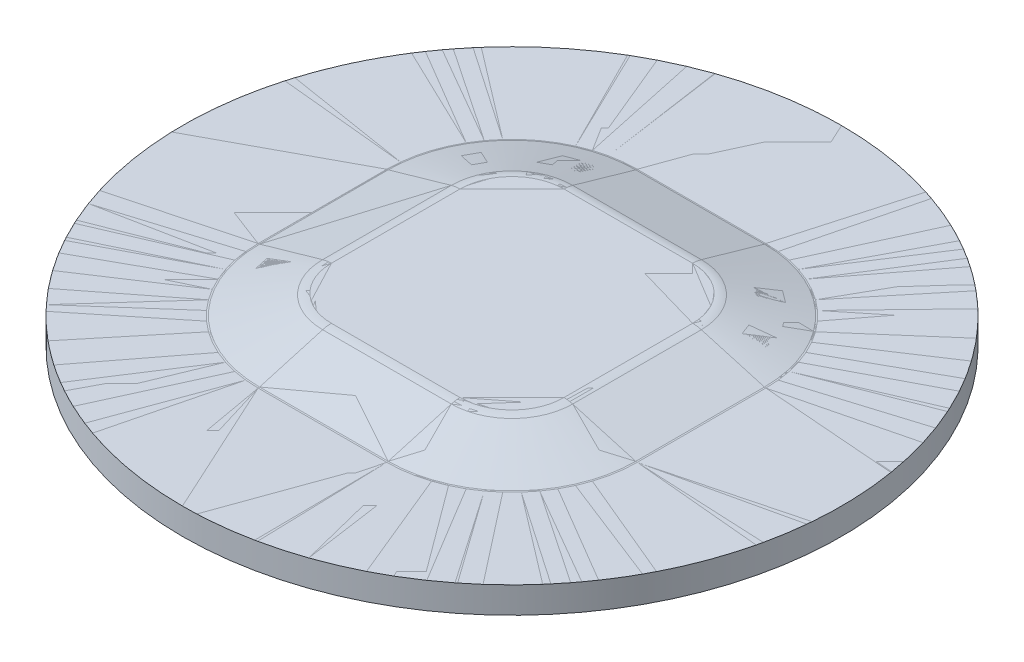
ISO-10303-21;
HEADER;
FILE_DESCRIPTION(('STEP AP214'),'2;1');
FILE_NAME('part.step','',(''),(''),'','','');
FILE_SCHEMA(('AUTOMOTIVE_DESIGN { 1 0 10303 214 1 1 1 1 }'));
ENDSEC;
DATA;
#1=APPLICATION_CONTEXT('core data for automotive mechanical design processes');
#2=APPLICATION_PROTOCOL_DEFINITION('international standard','automotive_design',2000,#1);
#3=PRODUCT_CONTEXT('',#1,'mechanical');
#4=PRODUCT('Part','Part','',(#3));
#5=PRODUCT_RELATED_PRODUCT_CATEGORY('part','',(#4));
#6=PRODUCT_DEFINITION_FORMATION('','',#4);
#7=PRODUCT_DEFINITION_CONTEXT('part definition',#1,'design');
#8=PRODUCT_DEFINITION('design','',#6,#7);
#9=PRODUCT_DEFINITION_SHAPE('','',#8);
#10=(LENGTH_UNIT() NAMED_UNIT(*) SI_UNIT(.MILLI.,.METRE.));
#11=(NAMED_UNIT(*) PLANE_ANGLE_UNIT() SI_UNIT($,.RADIAN.));
#12=(NAMED_UNIT(*) SI_UNIT($,.STERADIAN.) SOLID_ANGLE_UNIT());
#13=UNCERTAINTY_MEASURE_WITH_UNIT(LENGTH_MEASURE(1.E-05),#10,'distance_accuracy_value','');
#14=(GEOMETRIC_REPRESENTATION_CONTEXT(3) GLOBAL_UNCERTAINTY_ASSIGNED_CONTEXT((#13)) GLOBAL_UNIT_ASSIGNED_CONTEXT((#10,
#11,#12)) REPRESENTATION_CONTEXT('',''));
#15=CARTESIAN_POINT('',(0.,0.,0.));
#16=DIRECTION('',(0.,0.,1.));
#17=DIRECTION('',(1.,0.,0.));
#18=AXIS2_PLACEMENT_3D('',#15,#16,#17);
#19=CARTESIAN_POINT('',(-3.0988,0.,3.0988));
#20=DIRECTION('',(0.,-1.,0.));
#21=DIRECTION('',(0.,0.,-1.));
#22=AXIS2_PLACEMENT_3D('',#19,#20,#21);
#23=PLANE('',#22);
#24=DIRECTION('',(0.,0.,-1.));
#25=VECTOR('',#24,1.);
#26=CARTESIAN_POINT('',(-5.60241576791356,0.,3.0988));
#27=LINE('',#26,#25);
#28=CARTESIAN_POINT('',(-5.60241576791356,0.,3.09879999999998));
#29=VERTEX_POINT('',#28);
#30=CARTESIAN_POINT('',(-5.60241576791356,0.,-3.09879999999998));
#31=VERTEX_POINT('',#30);
#32=EDGE_CURVE('P0_E615',#29,#31,#27,.T.);
#33=ORIENTED_EDGE('',*,*,#32,.F.);
#34=CARTESIAN_POINT('',(-3.0988,0.,3.0988));
#35=DIRECTION('',(0.,-1.,0.));
#36=DIRECTION('',(0.,0.,1.));
#37=AXIS2_PLACEMENT_3D('',#34,#35,#36);
#38=CIRCLE('',#37,2.50361576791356);
#39=CARTESIAN_POINT('',(-3.09879999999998,0.,5.60241576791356));
#40=VERTEX_POINT('',#39);
#41=EDGE_CURVE('P0_E144',#40,#29,#38,.T.);
#42=ORIENTED_EDGE('',*,*,#41,.F.);
#43=DIRECTION('',(-1.,0.,0.));
#44=VECTOR('',#43,1.);
#45=CARTESIAN_POINT('',(-3.0988,0.,5.60241576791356));
#46=LINE('',#45,#44);
#47=CARTESIAN_POINT('',(3.09879999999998,0.,5.60241576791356));
#48=VERTEX_POINT('',#47);
#49=EDGE_CURVE('P0_E142',#48,#40,#46,.T.);
#50=ORIENTED_EDGE('',*,*,#49,.F.);
#51=CARTESIAN_POINT('',(3.0988,0.,3.0988));
#52=DIRECTION('',(0.,-1.,0.));
#53=DIRECTION('',(1.,0.,0.));
#54=AXIS2_PLACEMENT_3D('',#51,#52,#53);
#55=CIRCLE('',#54,2.50361576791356);
#56=CARTESIAN_POINT('',(5.60241576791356,0.,3.09879999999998));
#57=VERTEX_POINT('',#56);
#58=EDGE_CURVE('P0_E127',#57,#48,#55,.T.);
#59=ORIENTED_EDGE('',*,*,#58,.F.);
#60=DIRECTION('',(0.,0.,1.));
#61=VECTOR('',#60,1.);
#62=CARTESIAN_POINT('',(5.60241576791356,0.,3.0988));
#63=LINE('',#62,#61);
#64=CARTESIAN_POINT('',(5.60241576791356,0.,-3.09879999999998));
#65=VERTEX_POINT('',#64);
#66=EDGE_CURVE('P0_E267',#65,#57,#63,.T.);
#67=ORIENTED_EDGE('',*,*,#66,.F.);
#68=CARTESIAN_POINT('',(3.0988,0.,-3.0988));
#69=DIRECTION('',(0.,-1.,0.));
#70=DIRECTION('',(0.,0.,-1.));
#71=AXIS2_PLACEMENT_3D('',#68,#69,#70);
#72=CIRCLE('',#71,2.50361576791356);
#73=CARTESIAN_POINT('',(3.09879999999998,0.,-5.60241576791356));
#74=VERTEX_POINT('',#73);
#75=EDGE_CURVE('P0_E242',#74,#65,#72,.T.);
#76=ORIENTED_EDGE('',*,*,#75,.F.);
#77=DIRECTION('',(1.,0.,0.));
#78=VECTOR('',#77,1.);
#79=CARTESIAN_POINT('',(-3.0988,0.,-5.60241576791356));
#80=LINE('',#79,#78);
#81=CARTESIAN_POINT('',(-3.09879999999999,0.,-5.60241576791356));
#82=VERTEX_POINT('',#81);
#83=EDGE_CURVE('P0_E209',#82,#74,#80,.T.);
#84=ORIENTED_EDGE('',*,*,#83,.F.);
#85=CARTESIAN_POINT('',(-3.0988,0.,-3.0988));
#86=DIRECTION('',(0.,-1.,0.));
#87=DIRECTION('',(-1.,0.,0.));
#88=AXIS2_PLACEMENT_3D('',#85,#86,#87);
#89=CIRCLE('',#88,2.50361576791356);
#90=EDGE_CURVE('P0_E205',#31,#82,#89,.T.);
#91=ORIENTED_EDGE('',*,*,#90,.F.);
#92=EDGE_LOOP('',(#33,#42,#50,#59,#67,#76,#84,#91));
#93=FACE_BOUND('',#92,.T.);
#94=ADVANCED_FACE('P0_F17',(#93),#23,.F.);
#95=CARTESIAN_POINT('',(3.0988,-1.524,3.0988));
#96=DIRECTION('',(0.,-1.,0.));
#97=DIRECTION('',(0.,0.,-1.));
#98=AXIS2_PLACEMENT_3D('',#95,#96,#97);
#99=TOROIDAL_SURFACE('',#98,2.50361576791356,1.524);
#100=CARTESIAN_POINT('',(3.09879999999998,-1.524,5.60241576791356));
#101=DIRECTION('',(-1.,0.,0.));
#102=DIRECTION('',(0.,0.,1.));
#103=AXIS2_PLACEMENT_3D('',#100,#101,#102);
#104=CIRCLE('',#103,1.524);
#105=CARTESIAN_POINT('',(3.09879999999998,-0.0590371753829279,6.02248709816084));
#106=VERTEX_POINT('',#105);
#107=EDGE_CURVE('P0_E132',#106,#48,#104,.T.);
#108=ORIENTED_EDGE('',*,*,#107,.F.);
#109=CARTESIAN_POINT('',(3.0988,-0.0590371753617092,3.0988));
#110=DIRECTION('',(0.,-1.,0.));
#111=DIRECTION('',(0.,0.,1.));
#112=AXIS2_PLACEMENT_3D('',#109,#110,#111);
#113=CIRCLE('',#112,2.92368709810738);
#114=CARTESIAN_POINT('',(6.02248709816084,-0.0590371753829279,3.09879999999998));
#115=VERTEX_POINT('',#114);
#116=EDGE_CURVE('P0_E174',#115,#106,#113,.T.);
#117=ORIENTED_EDGE('',*,*,#116,.F.);
#118=CARTESIAN_POINT('',(5.60241576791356,-1.524,3.09879999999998));
#119=DIRECTION('',(0.,0.,1.));
#120=DIRECTION('',(1.,0.,0.));
#121=AXIS2_PLACEMENT_3D('',#118,#119,#120);
#122=CIRCLE('',#121,1.524);
#123=EDGE_CURVE('P0_E135',#57,#115,#122,.F.);
#124=ORIENTED_EDGE('',*,*,#123,.F.);
#125=ORIENTED_EDGE('',*,*,#58,.T.);
#126=EDGE_LOOP('',(#108,#117,#124,#125));
#127=FACE_BOUND('',#126,.T.);
#128=ADVANCED_FACE('P0_F130',(#127),#99,.T.);
#129=CARTESIAN_POINT('',(5.60241576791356,-1.524,3.0988));
#130=DIRECTION('',(0.,0.,1.));
#131=DIRECTION('',(1.,0.,0.));
#132=AXIS2_PLACEMENT_3D('',#129,#130,#131);
#133=CYLINDRICAL_SURFACE('',#132,1.524);
#134=CARTESIAN_POINT('',(5.60241576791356,-1.524,-3.09879999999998));
#135=DIRECTION('',(0.,0.,1.));
#136=DIRECTION('',(1.,0.,0.));
#137=AXIS2_PLACEMENT_3D('',#134,#135,#136);
#138=CIRCLE('',#137,1.524);
#139=CARTESIAN_POINT('',(6.02248709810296,-0.0590371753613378,-3.09879999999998));
#140=VERTEX_POINT('',#139);
#141=EDGE_CURVE('P0_E253',#65,#140,#138,.F.);
#142=ORIENTED_EDGE('',*,*,#141,.F.);
#143=ORIENTED_EDGE('',*,*,#66,.T.);
#144=ORIENTED_EDGE('',*,*,#123,.T.);
#145=DIRECTION('',(0.,0.,1.));
#146=VECTOR('',#145,1.);
#147=CARTESIAN_POINT('',(6.02248709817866,-0.0590371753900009,3.09879999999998));
#148=LINE('',#147,#146);
#149=EDGE_CURVE('P0_E544',#140,#115,#148,.T.);
#150=ORIENTED_EDGE('',*,*,#149,.F.);
#151=EDGE_LOOP('',(#142,#143,#144,#150));
#152=FACE_BOUND('',#151,.T.);
#153=ADVANCED_FACE('P0_F259',(#152),#133,.T.);
#154=CARTESIAN_POINT('',(3.0988,-1.524,-3.0988));
#155=DIRECTION('',(0.,-1.,0.));
#156=DIRECTION('',(0.,0.,-1.));
#157=AXIS2_PLACEMENT_3D('',#154,#155,#156);
#158=TOROIDAL_SURFACE('',#157,2.50361576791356,1.524);
#159=CARTESIAN_POINT('',(3.09879999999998,-1.524,-5.60241576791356));
#160=DIRECTION('',(1.,0.,0.));
#161=DIRECTION('',(0.,0.,-1.));
#162=AXIS2_PLACEMENT_3D('',#159,#160,#161);
#163=CIRCLE('',#162,1.524);
#164=CARTESIAN_POINT('',(3.09879999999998,-0.0590371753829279,-6.02248709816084));
#165=VERTEX_POINT('',#164);
#166=EDGE_CURVE('P0_E239',#74,#165,#163,.F.);
#167=ORIENTED_EDGE('',*,*,#166,.F.);
#168=ORIENTED_EDGE('',*,*,#75,.T.);
#169=ORIENTED_EDGE('',*,*,#141,.T.);
#170=CARTESIAN_POINT('',(3.0988,-0.0590371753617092,-3.0988));
#171=DIRECTION('',(0.,-1.,0.));
#172=DIRECTION('',(0.,0.,-1.));
#173=AXIS2_PLACEMENT_3D('',#170,#171,#172);
#174=CIRCLE('',#173,2.92368709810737);
#175=EDGE_CURVE('P0_E245',#165,#140,#174,.T.);
#176=ORIENTED_EDGE('',*,*,#175,.F.);
#177=EDGE_LOOP('',(#167,#168,#169,#176));
#178=FACE_BOUND('',#177,.T.);
#179=ADVANCED_FACE('P0_F255',(#178),#158,.T.);
#180=CARTESIAN_POINT('',(-3.0988,-1.524,-5.60241576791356));
#181=DIRECTION('',(1.,0.,0.));
#182=DIRECTION('',(0.,0.,-1.));
#183=AXIS2_PLACEMENT_3D('',#180,#181,#182);
#184=CYLINDRICAL_SURFACE('',#183,1.524);
#185=CARTESIAN_POINT('',(-3.0988,-1.524,-5.60241576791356));
#186=DIRECTION('',(1.,0.,0.));
#187=DIRECTION('',(0.,0.,-1.));
#188=AXIS2_PLACEMENT_3D('',#185,#186,#187);
#189=CIRCLE('',#188,1.524);
#190=CARTESIAN_POINT('',(-3.0988,-0.0590371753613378,-6.02248709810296));
#191=VERTEX_POINT('',#190);
#192=EDGE_CURVE('P0_E228',#82,#191,#189,.F.);
#193=ORIENTED_EDGE('',*,*,#192,.F.);
#194=ORIENTED_EDGE('',*,*,#83,.T.);
#195=ORIENTED_EDGE('',*,*,#166,.T.);
#196=DIRECTION('',(1.,0.,0.));
#197=VECTOR('',#196,1.);
#198=CARTESIAN_POINT('',(-3.09879999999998,-0.0590371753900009,-6.02248709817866));
#199=LINE('',#198,#197);
#200=EDGE_CURVE('P0_E232',#191,#165,#199,.T.);
#201=ORIENTED_EDGE('',*,*,#200,.F.);
#202=EDGE_LOOP('',(#193,#194,#195,#201));
#203=FACE_BOUND('',#202,.T.);
#204=ADVANCED_FACE('P0_F221',(#203),#184,.T.);
#205=CARTESIAN_POINT('',(-3.0988,-1.524,-3.0988));
#206=DIRECTION('',(0.,-1.,0.));
#207=DIRECTION('',(0.,0.,-1.));
#208=AXIS2_PLACEMENT_3D('',#205,#206,#207);
#209=TOROIDAL_SURFACE('',#208,2.50361576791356,1.524);
#210=CARTESIAN_POINT('',(-5.60241576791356,-1.524,-3.09879999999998));
#211=DIRECTION('',(0.,0.,-1.));
#212=DIRECTION('',(-1.,0.,0.));
#213=AXIS2_PLACEMENT_3D('',#210,#211,#212);
#214=CIRCLE('',#213,1.524);
#215=CARTESIAN_POINT('',(-6.02248709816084,-0.0590371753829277,-3.09879999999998));
#216=VERTEX_POINT('',#215);
#217=EDGE_CURVE('P0_E622',#31,#216,#214,.F.);
#218=ORIENTED_EDGE('',*,*,#217,.F.);
#219=ORIENTED_EDGE('',*,*,#90,.T.);
#220=ORIENTED_EDGE('',*,*,#192,.T.);
#221=CARTESIAN_POINT('',(-3.0988,-0.0590371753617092,-3.0988));
#222=DIRECTION('',(0.,-1.,0.));
#223=DIRECTION('',(0.,0.,-1.));
#224=AXIS2_PLACEMENT_3D('',#221,#222,#223);
#225=CIRCLE('',#224,2.92368709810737);
#226=EDGE_CURVE('P0_E522',#216,#191,#225,.T.);
#227=ORIENTED_EDGE('',*,*,#226,.F.);
#228=EDGE_LOOP('',(#218,#219,#220,#227));
#229=FACE_BOUND('',#228,.T.);
#230=ADVANCED_FACE('P0_F211',(#229),#209,.T.);
#231=CARTESIAN_POINT('',(-5.60241576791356,-1.524,3.0988));
#232=DIRECTION('',(0.,0.,-1.));
#233=DIRECTION('',(-1.,0.,0.));
#234=AXIS2_PLACEMENT_3D('',#231,#232,#233);
#235=CYLINDRICAL_SURFACE('',#234,1.524);
#236=CARTESIAN_POINT('',(-5.60241576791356,-1.524,3.09879999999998));
#237=DIRECTION('',(0.,0.,-1.));
#238=DIRECTION('',(-1.,0.,0.));
#239=AXIS2_PLACEMENT_3D('',#236,#237,#238);
#240=CIRCLE('',#239,1.524);
#241=CARTESIAN_POINT('',(-6.02248709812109,-0.0590371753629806,3.09879999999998));
#242=VERTEX_POINT('',#241);
#243=EDGE_CURVE('P0_E156',#29,#242,#240,.F.);
#244=ORIENTED_EDGE('',*,*,#243,.F.);
#245=ORIENTED_EDGE('',*,*,#32,.T.);
#246=ORIENTED_EDGE('',*,*,#217,.T.);
#247=DIRECTION('',(0.,0.,1.));
#248=VECTOR('',#247,1.);
#249=CARTESIAN_POINT('',(-6.02248709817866,-0.0590371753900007,3.09879999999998));
#250=LINE('',#249,#248);
#251=EDGE_CURVE('P0_E513',#242,#216,#250,.F.);
#252=ORIENTED_EDGE('',*,*,#251,.F.);
#253=EDGE_LOOP('',(#244,#245,#246,#252));
#254=FACE_BOUND('',#253,.T.);
#255=ADVANCED_FACE('P0_F185',(#254),#235,.T.);
#256=CARTESIAN_POINT('',(-3.0988,-1.524,3.0988));
#257=DIRECTION('',(0.,-1.,0.));
#258=DIRECTION('',(0.,0.,-1.));
#259=AXIS2_PLACEMENT_3D('',#256,#257,#258);
#260=TOROIDAL_SURFACE('',#259,2.50361576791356,1.524);
#261=ORIENTED_EDGE('',*,*,#243,.T.);
#262=CARTESIAN_POINT('',(-3.0988,-0.0590371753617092,3.0988));
#263=DIRECTION('',(0.,-1.,0.));
#264=DIRECTION('',(0.,0.,-1.));
#265=AXIS2_PLACEMENT_3D('',#262,#263,#264);
#266=CIRCLE('',#265,2.92368709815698);
#267=CARTESIAN_POINT('',(-3.09879999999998,-0.0590371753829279,6.02248709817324));
#268=VERTEX_POINT('',#267);
#269=EDGE_CURVE('P0_E166',#268,#242,#266,.T.);
#270=ORIENTED_EDGE('',*,*,#269,.F.);
#271=CARTESIAN_POINT('',(-3.09879999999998,-1.524,5.60241576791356));
#272=DIRECTION('',(-1.,0.,0.));
#273=DIRECTION('',(0.,0.,1.));
#274=AXIS2_PLACEMENT_3D('',#271,#272,#273);
#275=CIRCLE('',#274,1.524);
#276=EDGE_CURVE('P0_E149',#40,#268,#275,.F.);
#277=ORIENTED_EDGE('',*,*,#276,.F.);
#278=ORIENTED_EDGE('',*,*,#41,.T.);
#279=EDGE_LOOP('',(#261,#270,#277,#278));
#280=FACE_BOUND('',#279,.T.);
#281=ADVANCED_FACE('P0_F180',(#280),#260,.T.);
#282=CARTESIAN_POINT('',(-3.0988,-1.524,5.60241576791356));
#283=DIRECTION('',(-1.,0.,0.));
#284=DIRECTION('',(0.,0.,1.));
#285=AXIS2_PLACEMENT_3D('',#282,#283,#284);
#286=CYLINDRICAL_SURFACE('',#285,1.524);
#287=ORIENTED_EDGE('',*,*,#276,.T.);
#288=DIRECTION('',(1.,0.,0.));
#289=VECTOR('',#288,1.);
#290=CARTESIAN_POINT('',(-3.09879999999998,-0.0590371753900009,6.02248709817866));
#291=LINE('',#290,#289);
#292=EDGE_CURVE('P0_E154',#106,#268,#291,.F.);
#293=ORIENTED_EDGE('',*,*,#292,.F.);
#294=ORIENTED_EDGE('',*,*,#107,.T.);
#295=ORIENTED_EDGE('',*,*,#49,.T.);
#296=EDGE_LOOP('',(#287,#293,#294,#295));
#297=FACE_BOUND('',#296,.T.);
#298=ADVANCED_FACE('P0_F152',(#297),#286,.T.);
#299=CARTESIAN_POINT('',(3.0988,-0.929960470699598,3.0988));
#300=DIRECTION('',(0.,-1.,0.));
#301=DIRECTION('',(0.,0.,-1.));
#302=AXIS2_PLACEMENT_3D('',#299,#300,#301);
#303=CONICAL_SURFACE('',#302,5.96095757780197,1.29154364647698);
#304=DIRECTION('',(-0.96126169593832,0.275637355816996,0.));
#305=VECTOR('',#304,1.);
#306=CARTESIAN_POINT('',(5.8166,0.,3.09879999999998));
#307=LINE('',#306,#305);
#308=CARTESIAN_POINT('',(9.05975757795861,-0.929960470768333,3.09879999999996));
#309=VERTEX_POINT('',#308);
#310=EDGE_CURVE('P0_E547',#115,#309,#307,.F.);
#311=ORIENTED_EDGE('',*,*,#310,.F.);
#312=ORIENTED_EDGE('',*,*,#116,.T.);
#313=DIRECTION('',(0.,-0.275637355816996,0.96126169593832));
#314=VECTOR('',#313,1.);
#315=CARTESIAN_POINT('',(3.09879999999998,0.,5.8166));
#316=LINE('',#315,#314);
#317=CARTESIAN_POINT('',(3.09879999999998,-0.929960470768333,9.05975757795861));
#318=VERTEX_POINT('',#317);
#319=EDGE_CURVE('P0_E497',#318,#106,#316,.F.);
#320=ORIENTED_EDGE('',*,*,#319,.F.);
#321=CARTESIAN_POINT('',(3.0988,-0.929960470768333,3.0988));
#322=DIRECTION('',(0.,-1.,0.));
#323=DIRECTION('',(0.,0.,-1.));
#324=AXIS2_PLACEMENT_3D('',#321,#322,#323);
#325=CIRCLE('',#324,5.96095757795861);
#326=EDGE_CURVE('P0_E469',#318,#309,#325,.F.);
#327=ORIENTED_EDGE('',*,*,#326,.T.);
#328=EDGE_LOOP('',(#311,#312,#320,#327));
#329=FACE_BOUND('',#328,.T.);
#330=ADVANCED_FACE('P0_F560',(#329),#303,.T.);
#331=CARTESIAN_POINT('',(5.8166,0.,3.09879999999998));
#332=DIRECTION('',(0.275637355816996,0.96126169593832,0.));
#333=DIRECTION('',(-0.96126169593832,0.275637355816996,0.));
#334=AXIS2_PLACEMENT_3D('',#331,#332,#333);
#335=PLANE('',#334);
#336=DIRECTION('',(-0.96126169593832,0.275637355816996,0.));
#337=VECTOR('',#336,1.);
#338=CARTESIAN_POINT('',(499000.,-143084.279610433,-3.09879999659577));
#339=LINE('',#338,#337);
#340=CARTESIAN_POINT('',(9.05975757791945,-0.92996047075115,-3.09879999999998));
#341=VERTEX_POINT('',#340);
#342=EDGE_CURVE('P0_E248',#140,#341,#339,.F.);
#343=ORIENTED_EDGE('',*,*,#342,.F.);
#344=ORIENTED_EDGE('',*,*,#149,.T.);
#345=ORIENTED_EDGE('',*,*,#310,.T.);
#346=DIRECTION('',(0.,0.,-1.));
#347=VECTOR('',#346,1.);
#348=CARTESIAN_POINT('',(9.05975757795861,-0.929960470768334,3.09879999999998));
#349=LINE('',#348,#347);
#350=EDGE_CURVE('P0_E468',#309,#341,#349,.T.);
#351=ORIENTED_EDGE('',*,*,#350,.T.);
#352=EDGE_LOOP('',(#343,#344,#345,#351));
#353=FACE_BOUND('',#352,.T.);
#354=ADVANCED_FACE('P0_F564',(#353),#335,.T.);
#355=CARTESIAN_POINT('',(3.0988,-0.929960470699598,-3.0988));
#356=DIRECTION('',(0.,-1.,0.));
#357=DIRECTION('',(0.,0.,-1.));
#358=AXIS2_PLACEMENT_3D('',#355,#356,#357);
#359=CONICAL_SURFACE('',#358,5.96095757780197,1.29154364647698);
#360=DIRECTION('',(0.,0.275637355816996,0.96126169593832));
#361=VECTOR('',#360,1.);
#362=CARTESIAN_POINT('',(3.09879999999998,0.,-5.8166));
#363=LINE('',#362,#361);
#364=CARTESIAN_POINT('',(3.09879999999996,-0.929960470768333,-9.05975757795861));
#365=VERTEX_POINT('',#364);
#366=EDGE_CURVE('P0_E236',#165,#365,#363,.F.);
#367=ORIENTED_EDGE('',*,*,#366,.F.);
#368=ORIENTED_EDGE('',*,*,#175,.T.);
#369=ORIENTED_EDGE('',*,*,#342,.T.);
#370=CARTESIAN_POINT('',(3.0988,-0.929960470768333,-3.0988));
#371=DIRECTION('',(0.,-1.,0.));
#372=DIRECTION('',(0.,0.,-1.));
#373=AXIS2_PLACEMENT_3D('',#370,#371,#372);
#374=CIRCLE('',#373,5.96095757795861);
#375=EDGE_CURVE('P0_E462',#341,#365,#374,.F.);
#376=ORIENTED_EDGE('',*,*,#375,.T.);
#377=EDGE_LOOP('',(#367,#368,#369,#376));
#378=FACE_BOUND('',#377,.T.);
#379=ADVANCED_FACE('P0_F575',(#378),#359,.T.);
#380=CARTESIAN_POINT('',(-3.09879999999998,0.,-5.8166));
#381=DIRECTION('',(0.,0.96126169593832,-0.275637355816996));
#382=DIRECTION('',(0.,0.275637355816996,0.96126169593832));
#383=AXIS2_PLACEMENT_3D('',#380,#381,#382);
#384=PLANE('',#383);
#385=DIRECTION('',(0.,0.275637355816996,0.96126169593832));
#386=VECTOR('',#385,1.);
#387=CARTESIAN_POINT('',(-3.0988,-143084.279610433,-499000.));
#388=LINE('',#387,#386);
#389=CARTESIAN_POINT('',(-3.0988,-0.92996047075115,-9.05975757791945));
#390=VERTEX_POINT('',#389);
#391=EDGE_CURVE('P0_E235',#191,#390,#388,.F.);
#392=ORIENTED_EDGE('',*,*,#391,.F.);
#393=ORIENTED_EDGE('',*,*,#200,.T.);
#394=ORIENTED_EDGE('',*,*,#366,.T.);
#395=DIRECTION('',(-1.,0.,0.));
#396=VECTOR('',#395,1.);
#397=CARTESIAN_POINT('',(-3.09879999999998,-0.929960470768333,-9.05975757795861));
#398=LINE('',#397,#396);
#399=EDGE_CURVE('P0_E438',#365,#390,#398,.T.);
#400=ORIENTED_EDGE('',*,*,#399,.T.);
#401=EDGE_LOOP('',(#392,#393,#394,#400));
#402=FACE_BOUND('',#401,.T.);
#403=ADVANCED_FACE('P0_F578',(#402),#384,.T.);
#404=CARTESIAN_POINT('',(-3.0988,-0.929960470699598,-3.0988));
#405=DIRECTION('',(0.,-1.,0.));
#406=DIRECTION('',(0.,0.,-1.));
#407=AXIS2_PLACEMENT_3D('',#404,#405,#406);
#408=CONICAL_SURFACE('',#407,5.96095757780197,1.29154364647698);
#409=DIRECTION('',(-0.96126169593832,-0.275637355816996,0.));
#410=VECTOR('',#409,1.);
#411=CARTESIAN_POINT('',(-5.8166,0.,-3.09879999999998));
#412=LINE('',#411,#410);
#413=CARTESIAN_POINT('',(-9.05975757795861,-0.929960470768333,-3.09879999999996));
#414=VERTEX_POINT('',#413);
#415=EDGE_CURVE('P0_E519',#216,#414,#412,.T.);
#416=ORIENTED_EDGE('',*,*,#415,.F.);
#417=ORIENTED_EDGE('',*,*,#226,.T.);
#418=ORIENTED_EDGE('',*,*,#391,.T.);
#419=CARTESIAN_POINT('',(-3.0988,-0.929960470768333,-3.0988));
#420=DIRECTION('',(0.,-1.,0.));
#421=DIRECTION('',(0.,0.,-1.));
#422=AXIS2_PLACEMENT_3D('',#419,#420,#421);
#423=CIRCLE('',#422,5.96095757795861);
#424=EDGE_CURVE('P0_E432',#390,#414,#423,.F.);
#425=ORIENTED_EDGE('',*,*,#424,.T.);
#426=EDGE_LOOP('',(#416,#417,#418,#425));
#427=FACE_BOUND('',#426,.T.);
#428=ADVANCED_FACE('P0_F637',(#427),#408,.T.);
#429=CARTESIAN_POINT('',(-5.8166,0.,3.09879999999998));
#430=DIRECTION('',(-0.275637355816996,0.96126169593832,0.));
#431=DIRECTION('',(-0.96126169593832,-0.275637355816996,0.));
#432=AXIS2_PLACEMENT_3D('',#429,#430,#431);
#433=PLANE('',#432);
#434=DIRECTION('',(0.96126169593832,0.275637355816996,0.));
#435=VECTOR('',#434,1.);
#436=CARTESIAN_POINT('',(-499006.1976,-143086.056743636,3.09879999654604));
#437=LINE('',#436,#435);
#438=CARTESIAN_POINT('',(-9.05975757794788,-0.929960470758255,3.09879999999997));
#439=VERTEX_POINT('',#438);
#440=EDGE_CURVE('P0_E170',#242,#439,#437,.F.);
#441=ORIENTED_EDGE('',*,*,#440,.F.);
#442=ORIENTED_EDGE('',*,*,#251,.T.);
#443=ORIENTED_EDGE('',*,*,#415,.T.);
#444=DIRECTION('',(0.,0.,1.));
#445=VECTOR('',#444,1.);
#446=CARTESIAN_POINT('',(-9.05975757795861,-0.929960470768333,3.09879999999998));
#447=LINE('',#446,#445);
#448=EDGE_CURVE('P0_E408',#414,#439,#447,.T.);
#449=ORIENTED_EDGE('',*,*,#448,.T.);
#450=EDGE_LOOP('',(#441,#442,#443,#449));
#451=FACE_BOUND('',#450,.T.);
#452=ADVANCED_FACE('P0_F641',(#451),#433,.T.);
#453=CARTESIAN_POINT('',(-3.0988,-0.92996047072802,3.0988));
#454=DIRECTION('',(0.,-1.,0.));
#455=DIRECTION('',(1.,0.,0.));
#456=AXIS2_PLACEMENT_3D('',#453,#454,#455);
#457=CONICAL_SURFACE('',#456,5.96095757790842,1.29154364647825);
#458=DIRECTION('',(0.,-0.275637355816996,0.96126169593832));
#459=VECTOR('',#458,1.);
#460=CARTESIAN_POINT('',(-3.09879999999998,0.,5.8166));
#461=LINE('',#460,#459);
#462=CARTESIAN_POINT('',(-3.09879999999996,-0.929960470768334,9.05975757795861));
#463=VERTEX_POINT('',#462);
#464=EDGE_CURVE('P0_E169',#268,#463,#461,.T.);
#465=ORIENTED_EDGE('',*,*,#464,.F.);
#466=ORIENTED_EDGE('',*,*,#269,.T.);
#467=ORIENTED_EDGE('',*,*,#440,.T.);
#468=CARTESIAN_POINT('',(-3.0988,-0.929960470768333,3.0988));
#469=DIRECTION('',(0.,-1.,0.));
#470=DIRECTION('',(0.,0.,-1.));
#471=AXIS2_PLACEMENT_3D('',#468,#469,#470);
#472=CIRCLE('',#471,5.96095757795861);
#473=EDGE_CURVE('P0_E402',#439,#463,#472,.F.);
#474=ORIENTED_EDGE('',*,*,#473,.T.);
#475=EDGE_LOOP('',(#465,#466,#467,#474));
#476=FACE_BOUND('',#475,.T.);
#477=ADVANCED_FACE('P0_F648',(#476),#457,.T.);
#478=CARTESIAN_POINT('',(-3.09879999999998,0.,5.8166));
#479=DIRECTION('',(0.,0.96126169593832,0.275637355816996));
#480=DIRECTION('',(0.,-0.275637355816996,0.96126169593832));
#481=AXIS2_PLACEMENT_3D('',#478,#479,#480);
#482=PLANE('',#481);
#483=ORIENTED_EDGE('',*,*,#319,.T.);
#484=ORIENTED_EDGE('',*,*,#292,.T.);
#485=ORIENTED_EDGE('',*,*,#464,.T.);
#486=DIRECTION('',(1.,0.,0.));
#487=VECTOR('',#486,1.);
#488=CARTESIAN_POINT('',(-3.09879999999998,-0.929960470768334,9.05975757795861));
#489=LINE('',#488,#487);
#490=EDGE_CURVE('P0_E375',#463,#318,#489,.T.);
#491=ORIENTED_EDGE('',*,*,#490,.T.);
#492=EDGE_LOOP('',(#483,#484,#485,#491));
#493=FACE_BOUND('',#492,.T.);
#494=ADVANCED_FACE('P0_F479',(#493),#482,.T.);
#495=CARTESIAN_POINT('',(3.0988,-0.6858,3.0988));
#496=DIRECTION('',(0.,-1.,0.));
#497=DIRECTION('',(0.,0.,-1.));
#498=AXIS2_PLACEMENT_3D('',#495,#496,#497);
#499=TOROIDAL_SURFACE('',#498,6.03096946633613,0.254);
#500=ORIENTED_EDGE('',*,*,#326,.F.);
#501=CARTESIAN_POINT('',(3.09879999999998,-0.6858,9.12976946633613));
#502=DIRECTION('',(1.,0.,0.));
#503=DIRECTION('',(0.,0.,-1.));
#504=AXIS2_PLACEMENT_3D('',#501,#502,#503);
#505=CIRCLE('',#504,0.254000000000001);
#506=CARTESIAN_POINT('',(3.09879999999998,-0.9398,9.12976946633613));
#507=VERTEX_POINT('',#506);
#508=EDGE_CURVE('P0_E379',#318,#507,#505,.F.);
#509=ORIENTED_EDGE('',*,*,#508,.T.);
#510=CARTESIAN_POINT('',(3.0988,-0.9398,3.0988));
#511=DIRECTION('',(0.,1.,0.));
#512=DIRECTION('',(0.,0.,1.));
#513=AXIS2_PLACEMENT_3D('',#510,#511,#512);
#514=CIRCLE('',#513,6.03096946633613);
#515=CARTESIAN_POINT('',(9.12976946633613,-0.9398,3.09879999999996));
#516=VERTEX_POINT('',#515);
#517=EDGE_CURVE('P0_E370',#507,#516,#514,.T.);
#518=ORIENTED_EDGE('',*,*,#517,.T.);
#519=CARTESIAN_POINT('',(9.12976946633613,-0.6858,3.09879999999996));
#520=DIRECTION('',(0.,0.,-1.));
#521=DIRECTION('',(-1.,0.,0.));
#522=AXIS2_PLACEMENT_3D('',#519,#520,#521);
#523=CIRCLE('',#522,0.254000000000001);
#524=EDGE_CURVE('P0_E465',#516,#309,#523,.T.);
#525=ORIENTED_EDGE('',*,*,#524,.T.);
#526=EDGE_LOOP('',(#500,#509,#518,#525));
#527=FACE_BOUND('',#526,.T.);
#528=ADVANCED_FACE('P0_F475',(#527),#499,.F.);
#529=CARTESIAN_POINT('',(9.12976946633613,-0.6858,3.09879999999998));
#530=DIRECTION('',(0.,0.,-1.));
#531=DIRECTION('',(-1.,0.,0.));
#532=AXIS2_PLACEMENT_3D('',#529,#530,#531);
#533=CYLINDRICAL_SURFACE('',#532,0.254000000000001);
#534=ORIENTED_EDGE('',*,*,#350,.F.);
#535=ORIENTED_EDGE('',*,*,#524,.F.);
#536=DIRECTION('',(0.,0.,-1.));
#537=VECTOR('',#536,1.);
#538=CARTESIAN_POINT('',(9.12976946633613,-0.9398,0.));
#539=LINE('',#538,#537);
#540=CARTESIAN_POINT('',(9.12976946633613,-0.9398,-3.09879999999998));
#541=VERTEX_POINT('',#540);
#542=EDGE_CURVE('P0_E368',#516,#541,#539,.T.);
#543=ORIENTED_EDGE('',*,*,#542,.T.);
#544=CARTESIAN_POINT('',(9.12976946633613,-0.6858,-3.09879999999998));
#545=DIRECTION('',(0.,0.,1.));
#546=DIRECTION('',(1.,0.,0.));
#547=AXIS2_PLACEMENT_3D('',#544,#545,#546);
#548=CIRCLE('',#547,0.254);
#549=EDGE_CURVE('P0_E454',#541,#341,#548,.F.);
#550=ORIENTED_EDGE('',*,*,#549,.T.);
#551=EDGE_LOOP('',(#534,#535,#543,#550));
#552=FACE_BOUND('',#551,.T.);
#553=ADVANCED_FACE('P0_F448',(#552),#533,.F.);
#554=CARTESIAN_POINT('',(3.0988,-0.6858,-3.0988));
#555=DIRECTION('',(0.,-1.,0.));
#556=DIRECTION('',(0.,0.,-1.));
#557=AXIS2_PLACEMENT_3D('',#554,#555,#556);
#558=TOROIDAL_SURFACE('',#557,6.03096946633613,0.254);
#559=CARTESIAN_POINT('',(3.0988,-0.9398,-3.0988));
#560=DIRECTION('',(0.,1.,0.));
#561=DIRECTION('',(1.,0.,0.));
#562=AXIS2_PLACEMENT_3D('',#559,#560,#561);
#563=CIRCLE('',#562,6.03096946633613);
#564=CARTESIAN_POINT('',(3.09879999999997,-0.9398,-9.12976946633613));
#565=VERTEX_POINT('',#564);
#566=EDGE_CURVE('P0_E365',#541,#565,#563,.T.);
#567=ORIENTED_EDGE('',*,*,#566,.T.);
#568=CARTESIAN_POINT('',(3.09879999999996,-0.6858,-9.12976946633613));
#569=DIRECTION('',(-1.,0.,0.));
#570=DIRECTION('',(0.,0.,1.));
#571=AXIS2_PLACEMENT_3D('',#568,#569,#570);
#572=CIRCLE('',#571,0.254000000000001);
#573=EDGE_CURVE('P0_E435',#565,#365,#572,.T.);
#574=ORIENTED_EDGE('',*,*,#573,.T.);
#575=ORIENTED_EDGE('',*,*,#375,.F.);
#576=ORIENTED_EDGE('',*,*,#549,.F.);
#577=EDGE_LOOP('',(#567,#574,#575,#576));
#578=FACE_BOUND('',#577,.T.);
#579=ADVANCED_FACE('P0_F444',(#578),#558,.F.);
#580=CARTESIAN_POINT('',(-3.09879999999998,-0.6858,-9.12976946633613));
#581=DIRECTION('',(-1.,0.,0.));
#582=DIRECTION('',(0.,0.,1.));
#583=AXIS2_PLACEMENT_3D('',#580,#581,#582);
#584=CYLINDRICAL_SURFACE('',#583,0.254000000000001);
#585=DIRECTION('',(1.,0.,0.));
#586=VECTOR('',#585,1.);
#587=CARTESIAN_POINT('',(0.,-0.9398,-9.12976946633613));
#588=LINE('',#587,#586);
#589=CARTESIAN_POINT('',(-3.09879999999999,-0.9398,-9.12976946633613));
#590=VERTEX_POINT('',#589);
#591=EDGE_CURVE('P0_E363',#565,#590,#588,.F.);
#592=ORIENTED_EDGE('',*,*,#591,.T.);
#593=CARTESIAN_POINT('',(-3.0988,-0.6858,-9.12976946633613));
#594=DIRECTION('',(1.,0.,0.));
#595=DIRECTION('',(0.,0.,-1.));
#596=AXIS2_PLACEMENT_3D('',#593,#594,#595);
#597=CIRCLE('',#596,0.254);
#598=EDGE_CURVE('P0_E424',#590,#390,#597,.F.);
#599=ORIENTED_EDGE('',*,*,#598,.T.);
#600=ORIENTED_EDGE('',*,*,#399,.F.);
#601=ORIENTED_EDGE('',*,*,#573,.F.);
#602=EDGE_LOOP('',(#592,#599,#600,#601));
#603=FACE_BOUND('',#602,.T.);
#604=ADVANCED_FACE('P0_F418',(#603),#584,.F.);
#605=CARTESIAN_POINT('',(-3.0988,-0.6858,-3.0988));
#606=DIRECTION('',(0.,-1.,0.));
#607=DIRECTION('',(0.,0.,-1.));
#608=AXIS2_PLACEMENT_3D('',#605,#606,#607);
#609=TOROIDAL_SURFACE('',#608,6.03096946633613,0.254);
#610=CARTESIAN_POINT('',(-3.0988,-0.9398,-3.0988));
#611=DIRECTION('',(0.,1.,0.));
#612=DIRECTION('',(0.,0.,-1.));
#613=AXIS2_PLACEMENT_3D('',#610,#611,#612);
#614=CIRCLE('',#613,6.03096946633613);
#615=CARTESIAN_POINT('',(-9.12976946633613,-0.9398,-3.09879999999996));
#616=VERTEX_POINT('',#615);
#617=EDGE_CURVE('P0_E360',#590,#616,#614,.T.);
#618=ORIENTED_EDGE('',*,*,#617,.T.);
#619=CARTESIAN_POINT('',(-9.12976946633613,-0.6858,-3.09879999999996));
#620=DIRECTION('',(0.,0.,1.));
#621=DIRECTION('',(1.,0.,0.));
#622=AXIS2_PLACEMENT_3D('',#619,#620,#621);
#623=CIRCLE('',#622,0.254000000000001);
#624=EDGE_CURVE('P0_E405',#616,#414,#623,.T.);
#625=ORIENTED_EDGE('',*,*,#624,.T.);
#626=ORIENTED_EDGE('',*,*,#424,.F.);
#627=ORIENTED_EDGE('',*,*,#598,.F.);
#628=EDGE_LOOP('',(#618,#625,#626,#627));
#629=FACE_BOUND('',#628,.T.);
#630=ADVANCED_FACE('P0_F414',(#629),#609,.F.);
#631=CARTESIAN_POINT('',(-9.12976946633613,-0.6858,3.09879999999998));
#632=DIRECTION('',(0.,0.,1.));
#633=DIRECTION('',(1.,0.,0.));
#634=AXIS2_PLACEMENT_3D('',#631,#632,#633);
#635=CYLINDRICAL_SURFACE('',#634,0.254000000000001);
#636=DIRECTION('',(0.,0.,-1.));
#637=VECTOR('',#636,1.);
#638=CARTESIAN_POINT('',(-9.12976946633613,-0.9398,0.));
#639=LINE('',#638,#637);
#640=CARTESIAN_POINT('',(-9.12976946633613,-0.9398,3.09879999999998));
#641=VERTEX_POINT('',#640);
#642=EDGE_CURVE('P0_E358',#616,#641,#639,.F.);
#643=ORIENTED_EDGE('',*,*,#642,.T.);
#644=CARTESIAN_POINT('',(-9.12976946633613,-0.6858,3.09879999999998));
#645=DIRECTION('',(0.,0.,-1.));
#646=DIRECTION('',(-1.,0.,0.));
#647=AXIS2_PLACEMENT_3D('',#644,#645,#646);
#648=CIRCLE('',#647,0.254);
#649=EDGE_CURVE('P0_E376',#641,#439,#648,.F.);
#650=ORIENTED_EDGE('',*,*,#649,.T.);
#651=ORIENTED_EDGE('',*,*,#448,.F.);
#652=ORIENTED_EDGE('',*,*,#624,.F.);
#653=EDGE_LOOP('',(#643,#650,#651,#652));
#654=FACE_BOUND('',#653,.T.);
#655=ADVANCED_FACE('P0_F390',(#654),#635,.F.);
#656=CARTESIAN_POINT('',(-3.0988,-0.6858,3.0988));
#657=DIRECTION('',(0.,-1.,0.));
#658=DIRECTION('',(0.,0.,-1.));
#659=AXIS2_PLACEMENT_3D('',#656,#657,#658);
#660=TOROIDAL_SURFACE('',#659,6.03096946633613,0.254);
#661=CARTESIAN_POINT('',(-3.0988,-0.9398,3.0988));
#662=DIRECTION('',(0.,1.,0.));
#663=DIRECTION('',(-1.,0.,0.));
#664=AXIS2_PLACEMENT_3D('',#661,#662,#663);
#665=CIRCLE('',#664,6.03096946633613);
#666=CARTESIAN_POINT('',(-3.09879999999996,-0.9398,9.12976946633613));
#667=VERTEX_POINT('',#666);
#668=EDGE_CURVE('P0_E34',#641,#667,#665,.T.);
#669=ORIENTED_EDGE('',*,*,#668,.T.);
#670=CARTESIAN_POINT('',(-3.09879999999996,-0.6858,9.12976946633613));
#671=DIRECTION('',(1.,0.,0.));
#672=DIRECTION('',(0.,0.,-1.));
#673=AXIS2_PLACEMENT_3D('',#670,#671,#672);
#674=CIRCLE('',#673,0.254000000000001);
#675=EDGE_CURVE('P0_E373',#667,#463,#674,.T.);
#676=ORIENTED_EDGE('',*,*,#675,.T.);
#677=ORIENTED_EDGE('',*,*,#473,.F.);
#678=ORIENTED_EDGE('',*,*,#649,.F.);
#679=EDGE_LOOP('',(#669,#676,#677,#678));
#680=FACE_BOUND('',#679,.T.);
#681=ADVANCED_FACE('P0_F386',(#680),#660,.F.);
#682=CARTESIAN_POINT('',(-3.09879999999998,-0.6858,9.12976946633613));
#683=DIRECTION('',(1.,0.,0.));
#684=DIRECTION('',(0.,0.,-1.));
#685=AXIS2_PLACEMENT_3D('',#682,#683,#684);
#686=CYLINDRICAL_SURFACE('',#685,0.254000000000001);
#687=ORIENTED_EDGE('',*,*,#490,.F.);
#688=ORIENTED_EDGE('',*,*,#675,.F.);
#689=DIRECTION('',(1.,0.,0.));
#690=VECTOR('',#689,1.);
#691=CARTESIAN_POINT('',(0.,-0.9398,9.12976946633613));
#692=LINE('',#691,#690);
#693=EDGE_CURVE('P0_E348',#667,#507,#692,.T.);
#694=ORIENTED_EDGE('',*,*,#693,.T.);
#695=ORIENTED_EDGE('',*,*,#508,.F.);
#696=EDGE_LOOP('',(#687,#688,#694,#695));
#697=FACE_BOUND('',#696,.T.);
#698=ADVANCED_FACE('P0_F316',(#697),#686,.F.);
#699=CARTESIAN_POINT('',(0.,-0.9398,0.));
#700=DIRECTION('',(0.,-1.,0.));
#701=DIRECTION('',(0.,0.,-1.));
#702=AXIS2_PLACEMENT_3D('',#699,#700,#701);
#703=PLANE('',#702);
#704=CARTESIAN_POINT('',(0.,-0.9398,0.));
#705=DIRECTION('',(0.,1.,0.));
#706=DIRECTION('',(0.,0.,1.));
#707=AXIS2_PLACEMENT_3D('',#704,#705,#706);
#708=CIRCLE('',#707,15.875);
#709=CARTESIAN_POINT('',(0.,-0.9398,15.875));
#710=VERTEX_POINT('',#709);
#711=EDGE_CURVE('P0_E21',#710,#710,#708,.F.);
#712=ORIENTED_EDGE('',*,*,#711,.F.);
#713=EDGE_LOOP('',(#712));
#714=FACE_BOUND('',#713,.T.);
#715=ORIENTED_EDGE('',*,*,#668,.F.);
#716=ORIENTED_EDGE('',*,*,#642,.F.);
#717=ORIENTED_EDGE('',*,*,#617,.F.);
#718=ORIENTED_EDGE('',*,*,#591,.F.);
#719=ORIENTED_EDGE('',*,*,#566,.F.);
#720=ORIENTED_EDGE('',*,*,#542,.F.);
#721=ORIENTED_EDGE('',*,*,#517,.F.);
#722=ORIENTED_EDGE('',*,*,#693,.F.);
#723=EDGE_LOOP('',(#715,#716,#717,#718,#719,#720,#721,#722));
#724=FACE_BOUND('',#723,.T.);
#725=ADVANCED_FACE('P0_F309',(#714,#724),#703,.F.);
#726=CARTESIAN_POINT('',(0.,-2.2098,0.));
#727=DIRECTION('',(0.,1.,0.));
#728=DIRECTION('',(0.,0.,1.));
#729=AXIS2_PLACEMENT_3D('',#726,#727,#728);
#730=CYLINDRICAL_SURFACE('',#729,15.875);
#731=ORIENTED_EDGE('',*,*,#711,.T.);
#732=EDGE_LOOP('',(#731));
#733=FACE_BOUND('',#732,.T.);
#734=CARTESIAN_POINT('',(0.,-2.2098,0.));
#735=DIRECTION('',(0.,1.,0.));
#736=DIRECTION('',(0.,0.,1.));
#737=AXIS2_PLACEMENT_3D('',#734,#735,#736);
#738=CIRCLE('',#737,15.875);
#739=CARTESIAN_POINT('',(0.,-2.2098,15.875));
#740=VERTEX_POINT('',#739);
#741=EDGE_CURVE('P0_E11',#740,#740,#738,.F.);
#742=ORIENTED_EDGE('',*,*,#741,.F.);
#743=EDGE_LOOP('',(#742));
#744=FACE_BOUND('',#743,.T.);
#745=ADVANCED_FACE('P0_F303',(#733,#744),#730,.T.);
#746=CARTESIAN_POINT('',(0.,-2.2098,0.));
#747=DIRECTION('',(0.,-1.,0.));
#748=DIRECTION('',(0.,0.,-1.));
#749=AXIS2_PLACEMENT_3D('',#746,#747,#748);
#750=PLANE('',#749);
#751=ORIENTED_EDGE('',*,*,#741,.T.);
#752=EDGE_LOOP('',(#751));
#753=FACE_BOUND('',#752,.T.);
#754=ADVANCED_FACE('P0_F301',(#753),#750,.T.);
#755=CLOSED_SHELL('',(#94,#128,#153,#179,#204,#230,#255,#281,#298,#330,#354,#379,#403,#428,#452,
#477,#494,#528,#553,#579,#604,#630,#655,#681,#698,#725,#745,#754));
#756=MANIFOLD_SOLID_BREP('P0_B1',#755);
#757=CARTESIAN_POINT('',(0.,-0.9398,0.));
#758=DIRECTION('',(0.,-1.,0.));
#759=DIRECTION('',(0.,0.,-1.));
#760=AXIS2_PLACEMENT_3D('',#757,#758,#759);
#761=PLANE('',#760);
#762=CARTESIAN_POINT('',(0.,-0.9398,15.875));
#763=CARTESIAN_POINT('',(-1.45622280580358,-0.9398,15.875));
#764=CARTESIAN_POINT('',(-2.8886634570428,-0.9398,15.6099727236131));
#765=CARTESIAN_POINT('',(-4.40690852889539,-0.9398,15.3290700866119));
#766=CARTESIAN_POINT('',(-5.84350351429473,-0.9398,14.7603892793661));
#767=CARTESIAN_POINT('',(-7.33943071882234,-0.9398,14.1682216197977));
#768=CARTESIAN_POINT('',(-8.68695483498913,-0.9398,13.2873037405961));
#769=CARTESIAN_POINT('',(-10.0624820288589,-0.9398,12.3880793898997));
#770=CARTESIAN_POINT('',(-11.2253201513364,-0.9398,11.2253201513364));
#771=CARTESIAN_POINT('',(-12.3874008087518,-0.9398,10.063318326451));
#772=CARTESIAN_POINT('',(-13.2873037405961,-0.9398,8.68695483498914));
#773=CARTESIAN_POINT('',(-14.1677380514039,-0.9398,7.34036777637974));
#774=CARTESIAN_POINT('',(-14.7603892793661,-0.9398,5.84350351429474));
#775=CARTESIAN_POINT('',(-15.3287787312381,-0.9398,4.40791742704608));
#776=CARTESIAN_POINT('',(-15.6099727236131,-0.9398,2.8886634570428));
#777=CARTESIAN_POINT('',(-15.8749513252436,-0.9398,1.45701909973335));
#778=CARTESIAN_POINT('',(-15.875,-0.9398,0.));
#779=CARTESIAN_POINT('',(-15.8750486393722,-0.9398,-1.45595991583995));
#780=CARTESIAN_POINT('',(-15.6099727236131,-0.9398,-2.8886634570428));
#781=CARTESIAN_POINT('',(-15.3290700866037,-0.9398,-4.40690852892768));
#782=CARTESIAN_POINT('',(-14.7603892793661,-0.9398,-5.84350351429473));
#783=CARTESIAN_POINT('',(-14.1682216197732,-0.9398,-7.33943071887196));
#784=CARTESIAN_POINT('',(-13.2873037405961,-0.9398,-8.68695483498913));
#785=CARTESIAN_POINT('',(-12.3880793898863,-0.9398,-10.062482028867));
#786=CARTESIAN_POINT('',(-11.2253201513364,-0.9398,-11.2253201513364));
#787=CARTESIAN_POINT('',(-10.0633183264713,-0.9398,-12.3874008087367));
#788=CARTESIAN_POINT('',(-8.68695483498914,-0.9398,-13.2873037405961));
#789=CARTESIAN_POINT('',(-7.34036777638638,-0.9398,-14.1677380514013));
#790=CARTESIAN_POINT('',(-5.84350351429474,-0.9398,-14.7603892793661));
#791=CARTESIAN_POINT('',(-4.40791742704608,-0.9398,-15.3287787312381));
#792=CARTESIAN_POINT('',(-2.8886634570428,-0.9398,-15.6099727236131));
#793=CARTESIAN_POINT('',(-1.45675611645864,-0.9398,-15.875));
#794=CARTESIAN_POINT('',(0.,-0.9398,-15.875));
#795=B_SPLINE_CURVE_WITH_KNOTS('',2,(#762,#763,#764,#765,#766,#767,#768,#769,#770,#771,#772,
#773,#774,#775,#776,#777,#778,#779,#780,#781,#782,#783,#784,#785,#786,#787,#788,#789,#790,#791,
#792,#793,#794),.UNSPECIFIED.,.F.,.F.,(3,2,2,2,2,2,2,2,2,2,2,2,2,2,2,2,3),(0.,0.0625,0.125,
0.1875,0.25,0.3125,0.375,0.4375,0.5,0.5625,0.625,0.6875,0.75,0.8125,0.875,0.9375,1.),.UNSPECIFIED.);
#796=CARTESIAN_POINT('',(0.,-0.9398,15.875));
#797=VERTEX_POINT('',#796);
#798=CARTESIAN_POINT('',(0.,-0.9398,-15.875));
#799=VERTEX_POINT('',#798);
#800=EDGE_CURVE('P1_E28',#797,#799,#795,.T.);
#801=ORIENTED_EDGE('',*,*,#800,.T.);
#802=CARTESIAN_POINT('',(0.,-0.9398,-15.875));
#803=CARTESIAN_POINT('',(1.45622280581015,-0.9398,-15.875));
#804=CARTESIAN_POINT('',(2.8886634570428,-0.9398,-15.6099727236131));
#805=CARTESIAN_POINT('',(4.40690852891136,-0.9398,-15.3290700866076));
#806=CARTESIAN_POINT('',(5.84350351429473,-0.9398,-14.7603892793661));
#807=CARTESIAN_POINT('',(7.33943071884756,-0.9398,-14.1682216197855));
#808=CARTESIAN_POINT('',(8.68695483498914,-0.9398,-13.2873037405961));
#809=CARTESIAN_POINT('',(10.0624820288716,-0.9398,-12.3880793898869));
#810=CARTESIAN_POINT('',(11.2253201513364,-0.9398,-11.2253201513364));
#811=CARTESIAN_POINT('',(12.387400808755,-0.9398,-10.0633183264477));
#812=CARTESIAN_POINT('',(13.2873037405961,-0.9398,-8.68695483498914));
#813=CARTESIAN_POINT('',(14.1677380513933,-0.9398,-7.34036777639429));
#814=CARTESIAN_POINT('',(14.7603892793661,-0.9398,-5.84350351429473));
#815=CARTESIAN_POINT('',(15.3287787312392,-0.9398,-4.40791742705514));
#816=CARTESIAN_POINT('',(15.6099727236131,-0.9398,-2.8886634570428));
#817=CARTESIAN_POINT('',(15.8749513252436,-0.9398,-1.45701909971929));
#818=CARTESIAN_POINT('',(15.875,-0.9398,0.));
#819=CARTESIAN_POINT('',(15.8750486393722,-0.9398,1.45595991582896));
#820=CARTESIAN_POINT('',(15.6099727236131,-0.9398,2.8886634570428));
#821=CARTESIAN_POINT('',(15.3290700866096,-0.9398,4.40690852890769));
#822=CARTESIAN_POINT('',(14.7603892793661,-0.9398,5.84350351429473));
#823=CARTESIAN_POINT('',(14.1682216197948,-0.9398,7.33943071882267));
#824=CARTESIAN_POINT('',(13.2873037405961,-0.9398,8.68695483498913));
#825=CARTESIAN_POINT('',(12.3880793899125,-0.9398,10.0624820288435));
#826=CARTESIAN_POINT('',(11.2253201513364,-0.9398,11.2253201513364));
#827=CARTESIAN_POINT('',(10.0633183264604,-0.9398,12.387400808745));
#828=CARTESIAN_POINT('',(8.68695483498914,-0.9398,13.2873037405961));
#829=CARTESIAN_POINT('',(7.34036777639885,-0.9398,14.167738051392));
#830=CARTESIAN_POINT('',(5.84350351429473,-0.9398,14.7603892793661));
#831=CARTESIAN_POINT('',(4.40791742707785,-0.9398,15.3287787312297));
#832=CARTESIAN_POINT('',(2.8886634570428,-0.9398,15.6099727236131));
#833=CARTESIAN_POINT('',(1.45675611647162,-0.9398,15.875));
#834=CARTESIAN_POINT('',(0.,-0.9398,15.875));
#835=B_SPLINE_CURVE_WITH_KNOTS('',2,(#802,#803,#804,#805,#806,#807,#808,#809,#810,#811,#812,
#813,#814,#815,#816,#817,#818,#819,#820,#821,#822,#823,#824,#825,#826,#827,#828,#829,#830,#831,
#832,#833,#834),.UNSPECIFIED.,.F.,.F.,(3,2,2,2,2,2,2,2,2,2,2,2,2,2,2,2,3),(0.,0.0625,0.125,
0.1875,0.25,0.3125,0.375,0.4375,0.5,0.5625,0.625,0.6875,0.75,0.8125,0.875,0.9375,1.),.UNSPECIFIED.);
#836=EDGE_CURVE('P1_E11',#799,#797,#835,.T.);
#837=ORIENTED_EDGE('',*,*,#836,.T.);
#838=EDGE_LOOP('',(#801,#837));
#839=FACE_BOUND('',#838,.T.);
#840=CARTESIAN_POINT('',(-3.0988,-0.9398,3.0988));
#841=DIRECTION('',(0.,-1.,0.));
#842=DIRECTION('',(0.,0.,1.));
#843=AXIS2_PLACEMENT_3D('',#840,#841,#842);
#844=CIRCLE('',#843,6.03096946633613);
#845=CARTESIAN_POINT('',(-9.12976946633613,-0.9398,3.09879999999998));
#846=VERTEX_POINT('',#845);
#847=CARTESIAN_POINT('',(-3.09879999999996,-0.9398,9.12976946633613));
#848=VERTEX_POINT('',#847);
#849=EDGE_CURVE('P1_E162',#846,#848,#844,.F.);
#850=ORIENTED_EDGE('',*,*,#849,.T.);
#851=DIRECTION('',(1.,0.,0.));
#852=VECTOR('',#851,1.);
#853=CARTESIAN_POINT('',(0.,-0.9398,9.12976946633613));
#854=LINE('',#853,#852);
#855=CARTESIAN_POINT('',(3.09879999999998,-0.9398,9.12976946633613));
#856=VERTEX_POINT('',#855);
#857=EDGE_CURVE('P1_E155',#848,#856,#854,.T.);
#858=ORIENTED_EDGE('',*,*,#857,.T.);
#859=CARTESIAN_POINT('',(3.0988,-0.9398,3.0988));
#860=DIRECTION('',(0.,-1.,0.));
#861=DIRECTION('',(1.,0.,0.));
#862=AXIS2_PLACEMENT_3D('',#859,#860,#861);
#863=CIRCLE('',#862,6.03096946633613);
#864=CARTESIAN_POINT('',(9.12976946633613,-0.9398,3.09879999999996));
#865=VERTEX_POINT('',#864);
#866=EDGE_CURVE('P1_E134',#856,#865,#863,.F.);
#867=ORIENTED_EDGE('',*,*,#866,.T.);
#868=DIRECTION('',(0.,0.,-1.));
#869=VECTOR('',#868,1.);
#870=CARTESIAN_POINT('',(9.12976946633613,-0.9398,0.));
#871=LINE('',#870,#869);
#872=CARTESIAN_POINT('',(9.12976946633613,-0.9398,-3.09879999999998));
#873=VERTEX_POINT('',#872);
#874=EDGE_CURVE('P1_E148',#865,#873,#871,.T.);
#875=ORIENTED_EDGE('',*,*,#874,.T.);
#876=CARTESIAN_POINT('',(3.0988,-0.9398,-3.0988));
#877=DIRECTION('',(0.,-1.,0.));
#878=DIRECTION('',(0.,0.,-1.));
#879=AXIS2_PLACEMENT_3D('',#876,#877,#878);
#880=CIRCLE('',#879,6.03096946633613);
#881=CARTESIAN_POINT('',(3.09879999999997,-0.9398,-9.12976946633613));
#882=VERTEX_POINT('',#881);
#883=EDGE_CURVE('P1_E180',#873,#882,#880,.F.);
#884=ORIENTED_EDGE('',*,*,#883,.T.);
#885=DIRECTION('',(1.,0.,0.));
#886=VECTOR('',#885,1.);
#887=CARTESIAN_POINT('',(0.,-0.9398,-9.12976946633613));
#888=LINE('',#887,#886);
#889=CARTESIAN_POINT('',(-3.09879999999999,-0.9398,-9.12976946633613));
#890=VERTEX_POINT('',#889);
#891=EDGE_CURVE('P1_E177',#882,#890,#888,.F.);
#892=ORIENTED_EDGE('',*,*,#891,.T.);
#893=CARTESIAN_POINT('',(-3.0988,-0.9398,-3.0988));
#894=DIRECTION('',(0.,-1.,0.));
#895=DIRECTION('',(-1.,0.,0.));
#896=AXIS2_PLACEMENT_3D('',#893,#894,#895);
#897=CIRCLE('',#896,6.03096946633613);
#898=CARTESIAN_POINT('',(-9.12976946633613,-0.9398,-3.09879999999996));
#899=VERTEX_POINT('',#898);
#900=EDGE_CURVE('P1_E174',#890,#899,#897,.F.);
#901=ORIENTED_EDGE('',*,*,#900,.T.);
#902=DIRECTION('',(0.,0.,-1.));
#903=VECTOR('',#902,1.);
#904=CARTESIAN_POINT('',(-9.12976946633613,-0.9398,0.));
#905=LINE('',#904,#903);
#906=EDGE_CURVE('P1_E167',#899,#846,#905,.F.);
#907=ORIENTED_EDGE('',*,*,#906,.T.);
#908=EDGE_LOOP('',(#850,#858,#867,#875,#884,#892,#901,#907));
#909=FACE_BOUND('',#908,.T.);
#910=ADVANCED_FACE('P1_F18',(#839,#909),#761,.T.);
#911=CARTESIAN_POINT('',(-3.09879999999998,-0.6858,9.12976946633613));
#912=DIRECTION('',(1.,0.,0.));
#913=DIRECTION('',(0.,0.,-1.));
#914=AXIS2_PLACEMENT_3D('',#911,#912,#913);
#915=CYLINDRICAL_SURFACE('',#914,0.254000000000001);
#916=DIRECTION('',(1.,0.,0.));
#917=VECTOR('',#916,1.);
#918=CARTESIAN_POINT('',(-3.09879999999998,-0.929960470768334,9.05975757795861));
#919=LINE('',#918,#917);
#920=CARTESIAN_POINT('',(-3.09879999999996,-0.929960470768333,9.05975757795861));
#921=VERTEX_POINT('',#920);
#922=CARTESIAN_POINT('',(3.09879999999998,-0.929960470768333,9.05975757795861));
#923=VERTEX_POINT('',#922);
#924=EDGE_CURVE('P1_E158',#921,#923,#919,.T.);
#925=ORIENTED_EDGE('',*,*,#924,.T.);
#926=CARTESIAN_POINT('',(3.09879999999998,-0.6858,9.12976946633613));
#927=DIRECTION('',(1.,0.,0.));
#928=DIRECTION('',(0.,0.,-1.));
#929=AXIS2_PLACEMENT_3D('',#926,#927,#928);
#930=CIRCLE('',#929,0.254000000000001);
#931=EDGE_CURVE('P1_E139',#923,#856,#930,.F.);
#932=ORIENTED_EDGE('',*,*,#931,.T.);
#933=ORIENTED_EDGE('',*,*,#857,.F.);
#934=CARTESIAN_POINT('',(-3.09879999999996,-0.6858,9.12976946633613));
#935=DIRECTION('',(1.,0.,0.));
#936=DIRECTION('',(0.,0.,-1.));
#937=AXIS2_PLACEMENT_3D('',#934,#935,#936);
#938=CIRCLE('',#937,0.254000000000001);
#939=EDGE_CURVE('P1_E186',#848,#921,#938,.T.);
#940=ORIENTED_EDGE('',*,*,#939,.T.);
#941=EDGE_LOOP('',(#925,#932,#933,#940));
#942=FACE_BOUND('',#941,.T.);
#943=ADVANCED_FACE('P1_F153',(#942),#915,.T.);
#944=CARTESIAN_POINT('',(-3.0988,-0.6858,3.0988));
#945=DIRECTION('',(0.,-1.,0.));
#946=DIRECTION('',(0.,0.,-1.));
#947=AXIS2_PLACEMENT_3D('',#944,#945,#946);
#948=TOROIDAL_SURFACE('',#947,6.03096946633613,0.254);
#949=ORIENTED_EDGE('',*,*,#849,.F.);
#950=CARTESIAN_POINT('',(-9.12976946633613,-0.6858,3.09879999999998));
#951=DIRECTION('',(0.,0.,-1.));
#952=DIRECTION('',(-1.,0.,0.));
#953=AXIS2_PLACEMENT_3D('',#950,#951,#952);
#954=CIRCLE('',#953,0.254);
#955=CARTESIAN_POINT('',(-9.05975757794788,-0.929960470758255,3.09879999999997));
#956=VERTEX_POINT('',#955);
#957=EDGE_CURVE('P1_E188',#846,#956,#954,.F.);
#958=ORIENTED_EDGE('',*,*,#957,.T.);
#959=CARTESIAN_POINT('',(-3.0988,-0.929960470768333,3.0988));
#960=DIRECTION('',(0.,-1.,0.));
#961=DIRECTION('',(0.,0.,-1.));
#962=AXIS2_PLACEMENT_3D('',#959,#960,#961);
#963=CIRCLE('',#962,5.96095757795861);
#964=EDGE_CURVE('P1_E215',#956,#921,#963,.F.);
#965=ORIENTED_EDGE('',*,*,#964,.T.);
#966=ORIENTED_EDGE('',*,*,#939,.F.);
#967=EDGE_LOOP('',(#949,#958,#965,#966));
#968=FACE_BOUND('',#967,.T.);
#969=ADVANCED_FACE('P1_F197',(#968),#948,.T.);
#970=CARTESIAN_POINT('',(-9.12976946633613,-0.6858,3.09879999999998));
#971=DIRECTION('',(0.,0.,1.));
#972=DIRECTION('',(1.,0.,0.));
#973=AXIS2_PLACEMENT_3D('',#970,#971,#972);
#974=CYLINDRICAL_SURFACE('',#973,0.254000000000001);
#975=ORIENTED_EDGE('',*,*,#906,.F.);
#976=CARTESIAN_POINT('',(-9.12976946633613,-0.6858,-3.09879999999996));
#977=DIRECTION('',(0.,0.,1.));
#978=DIRECTION('',(1.,0.,0.));
#979=AXIS2_PLACEMENT_3D('',#976,#977,#978);
#980=CIRCLE('',#979,0.254000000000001);
#981=CARTESIAN_POINT('',(-9.05975757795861,-0.929960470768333,-3.09879999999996));
#982=VERTEX_POINT('',#981);
#983=EDGE_CURVE('P1_E218',#899,#982,#980,.T.);
#984=ORIENTED_EDGE('',*,*,#983,.T.);
#985=DIRECTION('',(0.,0.,1.));
#986=VECTOR('',#985,1.);
#987=CARTESIAN_POINT('',(-9.05975757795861,-0.929960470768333,3.09879999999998));
#988=LINE('',#987,#986);
#989=EDGE_CURVE('P1_E221',#982,#956,#988,.T.);
#990=ORIENTED_EDGE('',*,*,#989,.T.);
#991=ORIENTED_EDGE('',*,*,#957,.F.);
#992=EDGE_LOOP('',(#975,#984,#990,#991));
#993=FACE_BOUND('',#992,.T.);
#994=ADVANCED_FACE('P1_F202',(#993),#974,.T.);
#995=CARTESIAN_POINT('',(-3.0988,-0.6858,-3.0988));
#996=DIRECTION('',(0.,-1.,0.));
#997=DIRECTION('',(0.,0.,-1.));
#998=AXIS2_PLACEMENT_3D('',#995,#996,#997);
#999=TOROIDAL_SURFACE('',#998,6.03096946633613,0.254);
#1000=ORIENTED_EDGE('',*,*,#900,.F.);
#1001=CARTESIAN_POINT('',(-3.0988,-0.6858,-9.12976946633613));
#1002=DIRECTION('',(1.,0.,0.));
#1003=DIRECTION('',(0.,0.,-1.));
#1004=AXIS2_PLACEMENT_3D('',#1001,#1002,#1003);
#1005=CIRCLE('',#1004,0.254);
#1006=CARTESIAN_POINT('',(-3.0988,-0.92996047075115,-9.05975757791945));
#1007=VERTEX_POINT('',#1006);
#1008=EDGE_CURVE('P1_E238',#890,#1007,#1005,.F.);
#1009=ORIENTED_EDGE('',*,*,#1008,.T.);
#1010=CARTESIAN_POINT('',(-3.0988,-0.929960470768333,-3.0988));
#1011=DIRECTION('',(0.,-1.,0.));
#1012=DIRECTION('',(0.,0.,-1.));
#1013=AXIS2_PLACEMENT_3D('',#1010,#1011,#1012);
#1014=CIRCLE('',#1013,5.96095757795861);
#1015=EDGE_CURVE('P1_E246',#1007,#982,#1014,.F.);
#1016=ORIENTED_EDGE('',*,*,#1015,.T.);
#1017=ORIENTED_EDGE('',*,*,#983,.F.);
#1018=EDGE_LOOP('',(#1000,#1009,#1016,#1017));
#1019=FACE_BOUND('',#1018,.T.);
#1020=ADVANCED_FACE('P1_F228',(#1019),#999,.T.);
#1021=CARTESIAN_POINT('',(-3.09879999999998,-0.6858,-9.12976946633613));
#1022=DIRECTION('',(-1.,0.,0.));
#1023=DIRECTION('',(0.,0.,1.));
#1024=AXIS2_PLACEMENT_3D('',#1021,#1022,#1023);
#1025=CYLINDRICAL_SURFACE('',#1024,0.254000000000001);
#1026=ORIENTED_EDGE('',*,*,#891,.F.);
#1027=CARTESIAN_POINT('',(3.09879999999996,-0.6858,-9.12976946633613));
#1028=DIRECTION('',(-1.,0.,0.));
#1029=DIRECTION('',(0.,0.,1.));
#1030=AXIS2_PLACEMENT_3D('',#1027,#1028,#1029);
#1031=CIRCLE('',#1030,0.254000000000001);
#1032=CARTESIAN_POINT('',(3.09879999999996,-0.929960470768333,-9.05975757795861));
#1033=VERTEX_POINT('',#1032);
#1034=EDGE_CURVE('P1_E249',#882,#1033,#1031,.T.);
#1035=ORIENTED_EDGE('',*,*,#1034,.T.);
#1036=DIRECTION('',(-1.,0.,0.));
#1037=VECTOR('',#1036,1.);
#1038=CARTESIAN_POINT('',(-3.09879999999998,-0.929960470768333,-9.05975757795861));
#1039=LINE('',#1038,#1037);
#1040=EDGE_CURVE('P1_E252',#1033,#1007,#1039,.T.);
#1041=ORIENTED_EDGE('',*,*,#1040,.T.);
#1042=ORIENTED_EDGE('',*,*,#1008,.F.);
#1043=EDGE_LOOP('',(#1026,#1035,#1041,#1042));
#1044=FACE_BOUND('',#1043,.T.);
#1045=ADVANCED_FACE('P1_F232',(#1044),#1025,.T.);
#1046=CARTESIAN_POINT('',(3.0988,-0.6858,-3.0988));
#1047=DIRECTION('',(0.,-1.,0.));
#1048=DIRECTION('',(0.,0.,-1.));
#1049=AXIS2_PLACEMENT_3D('',#1046,#1047,#1048);
#1050=TOROIDAL_SURFACE('',#1049,6.03096946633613,0.254);
#1051=ORIENTED_EDGE('',*,*,#883,.F.);
#1052=CARTESIAN_POINT('',(9.12976946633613,-0.6858,-3.09879999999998));
#1053=DIRECTION('',(0.,0.,1.));
#1054=DIRECTION('',(1.,0.,0.));
#1055=AXIS2_PLACEMENT_3D('',#1052,#1053,#1054);
#1056=CIRCLE('',#1055,0.254);
#1057=CARTESIAN_POINT('',(9.05975757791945,-0.92996047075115,-3.09879999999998));
#1058=VERTEX_POINT('',#1057);
#1059=EDGE_CURVE('P1_E269',#873,#1058,#1056,.F.);
#1060=ORIENTED_EDGE('',*,*,#1059,.T.);
#1061=CARTESIAN_POINT('',(3.0988,-0.929960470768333,-3.0988));
#1062=DIRECTION('',(0.,-1.,0.));
#1063=DIRECTION('',(0.,0.,-1.));
#1064=AXIS2_PLACEMENT_3D('',#1061,#1062,#1063);
#1065=CIRCLE('',#1064,5.96095757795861);
#1066=EDGE_CURVE('P1_E277',#1058,#1033,#1065,.F.);
#1067=ORIENTED_EDGE('',*,*,#1066,.T.);
#1068=ORIENTED_EDGE('',*,*,#1034,.F.);
#1069=EDGE_LOOP('',(#1051,#1060,#1067,#1068));
#1070=FACE_BOUND('',#1069,.T.);
#1071=ADVANCED_FACE('P1_F259',(#1070),#1050,.T.);
#1072=CARTESIAN_POINT('',(9.12976946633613,-0.6858,3.09879999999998));
#1073=DIRECTION('',(0.,0.,-1.));
#1074=DIRECTION('',(-1.,0.,0.));
#1075=AXIS2_PLACEMENT_3D('',#1072,#1073,#1074);
#1076=CYLINDRICAL_SURFACE('',#1075,0.254000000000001);
#1077=DIRECTION('',(0.,0.,-1.));
#1078=VECTOR('',#1077,1.);
#1079=CARTESIAN_POINT('',(9.05975757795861,-0.929960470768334,3.09879999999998));
#1080=LINE('',#1079,#1078);
#1081=CARTESIAN_POINT('',(9.05975757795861,-0.929960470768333,3.09879999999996));
#1082=VERTEX_POINT('',#1081);
#1083=EDGE_CURVE('P1_E281',#1082,#1058,#1080,.T.);
#1084=ORIENTED_EDGE('',*,*,#1083,.T.);
#1085=ORIENTED_EDGE('',*,*,#1059,.F.);
#1086=ORIENTED_EDGE('',*,*,#874,.F.);
#1087=CARTESIAN_POINT('',(9.12976946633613,-0.6858,3.09879999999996));
#1088=DIRECTION('',(0.,0.,-1.));
#1089=DIRECTION('',(-1.,0.,0.));
#1090=AXIS2_PLACEMENT_3D('',#1087,#1088,#1089);
#1091=CIRCLE('',#1090,0.254000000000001);
#1092=EDGE_CURVE('P1_E142',#865,#1082,#1091,.T.);
#1093=ORIENTED_EDGE('',*,*,#1092,.T.);
#1094=EDGE_LOOP('',(#1084,#1085,#1086,#1093));
#1095=FACE_BOUND('',#1094,.T.);
#1096=ADVANCED_FACE('P1_F263',(#1095),#1076,.T.);
#1097=CARTESIAN_POINT('',(3.0988,-0.6858,3.0988));
#1098=DIRECTION('',(0.,-1.,0.));
#1099=DIRECTION('',(0.,0.,-1.));
#1100=AXIS2_PLACEMENT_3D('',#1097,#1098,#1099);
#1101=TOROIDAL_SURFACE('',#1100,6.03096946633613,0.254);
#1102=CARTESIAN_POINT('',(3.0988,-0.929960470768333,3.0988));
#1103=DIRECTION('',(0.,-1.,0.));
#1104=DIRECTION('',(0.,0.,-1.));
#1105=AXIS2_PLACEMENT_3D('',#1102,#1103,#1104);
#1106=CIRCLE('',#1105,5.96095757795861);
#1107=EDGE_CURVE('P1_E282',#923,#1082,#1106,.F.);
#1108=ORIENTED_EDGE('',*,*,#1107,.T.);
#1109=ORIENTED_EDGE('',*,*,#1092,.F.);
#1110=ORIENTED_EDGE('',*,*,#866,.F.);
#1111=ORIENTED_EDGE('',*,*,#931,.F.);
#1112=EDGE_LOOP('',(#1108,#1109,#1110,#1111));
#1113=FACE_BOUND('',#1112,.T.);
#1114=ADVANCED_FACE('P1_F138',(#1113),#1101,.T.);
#1115=CARTESIAN_POINT('',(-3.09879999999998,0.,5.8166));
#1116=DIRECTION('',(0.,0.96126169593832,0.275637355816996));
#1117=DIRECTION('',(0.,-0.275637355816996,0.96126169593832));
#1118=AXIS2_PLACEMENT_3D('',#1115,#1116,#1117);
#1119=PLANE('',#1118);
#1120=DIRECTION('',(0.,-0.275637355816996,0.96126169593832));
#1121=VECTOR('',#1120,1.);
#1122=CARTESIAN_POINT('',(3.09879999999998,0.,5.8166));
#1123=LINE('',#1122,#1121);
#1124=CARTESIAN_POINT('',(3.09879999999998,-0.0590371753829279,6.02248709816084));
#1125=VERTEX_POINT('',#1124);
#1126=EDGE_CURVE('P1_E305',#923,#1125,#1123,.F.);
#1127=ORIENTED_EDGE('',*,*,#1126,.F.);
#1128=ORIENTED_EDGE('',*,*,#924,.F.);
#1129=DIRECTION('',(0.,-0.275637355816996,0.96126169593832));
#1130=VECTOR('',#1129,1.);
#1131=CARTESIAN_POINT('',(-3.09879999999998,0.,5.8166));
#1132=LINE('',#1131,#1130);
#1133=CARTESIAN_POINT('',(-3.09879999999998,-0.0590371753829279,6.02248709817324));
#1134=VERTEX_POINT('',#1133);
#1135=EDGE_CURVE('P1_E308',#1134,#921,#1132,.T.);
#1136=ORIENTED_EDGE('',*,*,#1135,.F.);
#1137=DIRECTION('',(1.,0.,0.));
#1138=VECTOR('',#1137,1.);
#1139=CARTESIAN_POINT('',(-3.09879999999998,-0.0590371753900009,6.02248709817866));
#1140=LINE('',#1139,#1138);
#1141=EDGE_CURVE('P1_E299',#1125,#1134,#1140,.F.);
#1142=ORIENTED_EDGE('',*,*,#1141,.F.);
#1143=EDGE_LOOP('',(#1127,#1128,#1136,#1142));
#1144=FACE_BOUND('',#1143,.T.);
#1145=ADVANCED_FACE('P1_F288',(#1144),#1119,.F.);
#1146=CARTESIAN_POINT('',(-3.0988,-0.92996047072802,3.0988));
#1147=DIRECTION('',(0.,-1.,0.));
#1148=DIRECTION('',(1.,0.,0.));
#1149=AXIS2_PLACEMENT_3D('',#1146,#1147,#1148);
#1150=CONICAL_SURFACE('',#1149,5.96095757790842,1.29154364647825);
#1151=ORIENTED_EDGE('',*,*,#1135,.T.);
#1152=ORIENTED_EDGE('',*,*,#964,.F.);
#1153=DIRECTION('',(0.96126169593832,0.275637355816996,0.));
#1154=VECTOR('',#1153,1.);
#1155=CARTESIAN_POINT('',(-499006.1976,-143086.056743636,3.09879999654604));
#1156=LINE('',#1155,#1154);
#1157=CARTESIAN_POINT('',(-6.02248709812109,-0.0590371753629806,3.09879999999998));
#1158=VERTEX_POINT('',#1157);
#1159=EDGE_CURVE('P1_E323',#1158,#956,#1156,.F.);
#1160=ORIENTED_EDGE('',*,*,#1159,.F.);
#1161=CARTESIAN_POINT('',(-3.0988,-0.0590371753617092,3.0988));
#1162=DIRECTION('',(0.,-1.,0.));
#1163=DIRECTION('',(0.,0.,-1.));
#1164=AXIS2_PLACEMENT_3D('',#1161,#1162,#1163);
#1165=CIRCLE('',#1164,2.92368709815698);
#1166=EDGE_CURVE('P1_E312',#1134,#1158,#1165,.T.);
#1167=ORIENTED_EDGE('',*,*,#1166,.F.);
#1168=EDGE_LOOP('',(#1151,#1152,#1160,#1167));
#1169=FACE_BOUND('',#1168,.T.);
#1170=ADVANCED_FACE('P1_F601',(#1169),#1150,.F.);
#1171=CARTESIAN_POINT('',(-5.8166,0.,3.09879999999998));
#1172=DIRECTION('',(-0.275637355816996,0.96126169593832,0.));
#1173=DIRECTION('',(-0.96126169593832,-0.275637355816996,0.));
#1174=AXIS2_PLACEMENT_3D('',#1171,#1172,#1173);
#1175=PLANE('',#1174);
#1176=ORIENTED_EDGE('',*,*,#1159,.T.);
#1177=ORIENTED_EDGE('',*,*,#989,.F.);
#1178=DIRECTION('',(-0.96126169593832,-0.275637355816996,0.));
#1179=VECTOR('',#1178,1.);
#1180=CARTESIAN_POINT('',(-5.8166,0.,-3.09879999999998));
#1181=LINE('',#1180,#1179);
#1182=CARTESIAN_POINT('',(-6.02248709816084,-0.0590371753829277,-3.09879999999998));
#1183=VERTEX_POINT('',#1182);
#1184=EDGE_CURVE('P1_E332',#1183,#982,#1181,.T.);
#1185=ORIENTED_EDGE('',*,*,#1184,.F.);
#1186=DIRECTION('',(0.,0.,1.));
#1187=VECTOR('',#1186,1.);
#1188=CARTESIAN_POINT('',(-6.02248709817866,-0.0590371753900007,3.09879999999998));
#1189=LINE('',#1188,#1187);
#1190=EDGE_CURVE('P1_E325',#1158,#1183,#1189,.F.);
#1191=ORIENTED_EDGE('',*,*,#1190,.F.);
#1192=EDGE_LOOP('',(#1176,#1177,#1185,#1191));
#1193=FACE_BOUND('',#1192,.T.);
#1194=ADVANCED_FACE('P1_F593',(#1193),#1175,.F.);
#1195=CARTESIAN_POINT('',(-3.0988,-0.929960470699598,-3.0988));
#1196=DIRECTION('',(0.,-1.,0.));
#1197=DIRECTION('',(0.,0.,-1.));
#1198=AXIS2_PLACEMENT_3D('',#1195,#1196,#1197);
#1199=CONICAL_SURFACE('',#1198,5.96095757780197,1.29154364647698);
#1200=ORIENTED_EDGE('',*,*,#1184,.T.);
#1201=ORIENTED_EDGE('',*,*,#1015,.F.);
#1202=DIRECTION('',(0.,0.275637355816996,0.96126169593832));
#1203=VECTOR('',#1202,1.);
#1204=CARTESIAN_POINT('',(-3.0988,-143084.279610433,-499000.));
#1205=LINE('',#1204,#1203);
#1206=CARTESIAN_POINT('',(-3.0988,-0.0590371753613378,-6.02248709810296));
#1207=VERTEX_POINT('',#1206);
#1208=EDGE_CURVE('P1_E341',#1207,#1007,#1205,.F.);
#1209=ORIENTED_EDGE('',*,*,#1208,.F.);
#1210=CARTESIAN_POINT('',(-3.0988,-0.0590371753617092,-3.0988));
#1211=DIRECTION('',(0.,-1.,0.));
#1212=DIRECTION('',(0.,0.,-1.));
#1213=AXIS2_PLACEMENT_3D('',#1210,#1211,#1212);
#1214=CIRCLE('',#1213,2.92368709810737);
#1215=EDGE_CURVE('P1_E334',#1183,#1207,#1214,.T.);
#1216=ORIENTED_EDGE('',*,*,#1215,.F.);
#1217=EDGE_LOOP('',(#1200,#1201,#1209,#1216));
#1218=FACE_BOUND('',#1217,.T.);
#1219=ADVANCED_FACE('P1_F585',(#1218),#1199,.F.);
#1220=CARTESIAN_POINT('',(-3.09879999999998,0.,-5.8166));
#1221=DIRECTION('',(0.,0.96126169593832,-0.275637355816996));
#1222=DIRECTION('',(0.,0.275637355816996,0.96126169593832));
#1223=AXIS2_PLACEMENT_3D('',#1220,#1221,#1222);
#1224=PLANE('',#1223);
#1225=ORIENTED_EDGE('',*,*,#1208,.T.);
#1226=ORIENTED_EDGE('',*,*,#1040,.F.);
#1227=DIRECTION('',(0.,0.275637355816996,0.96126169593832));
#1228=VECTOR('',#1227,1.);
#1229=CARTESIAN_POINT('',(3.09879999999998,0.,-5.8166));
#1230=LINE('',#1229,#1228);
#1231=CARTESIAN_POINT('',(3.09879999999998,-0.0590371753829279,-6.02248709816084));
#1232=VERTEX_POINT('',#1231);
#1233=EDGE_CURVE('P1_E350',#1232,#1033,#1230,.F.);
#1234=ORIENTED_EDGE('',*,*,#1233,.F.);
#1235=DIRECTION('',(1.,0.,0.));
#1236=VECTOR('',#1235,1.);
#1237=CARTESIAN_POINT('',(-3.09879999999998,-0.0590371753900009,-6.02248709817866));
#1238=LINE('',#1237,#1236);
#1239=EDGE_CURVE('P1_E343',#1207,#1232,#1238,.T.);
#1240=ORIENTED_EDGE('',*,*,#1239,.F.);
#1241=EDGE_LOOP('',(#1225,#1226,#1234,#1240));
#1242=FACE_BOUND('',#1241,.T.);
#1243=ADVANCED_FACE('P1_F577',(#1242),#1224,.F.);
#1244=CARTESIAN_POINT('',(3.0988,-0.929960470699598,-3.0988));
#1245=DIRECTION('',(0.,-1.,0.));
#1246=DIRECTION('',(0.,0.,-1.));
#1247=AXIS2_PLACEMENT_3D('',#1244,#1245,#1246);
#1248=CONICAL_SURFACE('',#1247,5.96095757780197,1.29154364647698);
#1249=ORIENTED_EDGE('',*,*,#1233,.T.);
#1250=ORIENTED_EDGE('',*,*,#1066,.F.);
#1251=DIRECTION('',(-0.96126169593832,0.275637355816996,0.));
#1252=VECTOR('',#1251,1.);
#1253=CARTESIAN_POINT('',(499000.,-143084.279610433,-3.09879999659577));
#1254=LINE('',#1253,#1252);
#1255=CARTESIAN_POINT('',(6.02248709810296,-0.0590371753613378,-3.09879999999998));
#1256=VERTEX_POINT('',#1255);
#1257=EDGE_CURVE('P1_E359',#1256,#1058,#1254,.F.);
#1258=ORIENTED_EDGE('',*,*,#1257,.F.);
#1259=CARTESIAN_POINT('',(3.0988,-0.0590371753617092,-3.0988));
#1260=DIRECTION('',(0.,-1.,0.));
#1261=DIRECTION('',(0.,0.,-1.));
#1262=AXIS2_PLACEMENT_3D('',#1259,#1260,#1261);
#1263=CIRCLE('',#1262,2.92368709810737);
#1264=EDGE_CURVE('P1_E352',#1232,#1256,#1263,.T.);
#1265=ORIENTED_EDGE('',*,*,#1264,.F.);
#1266=EDGE_LOOP('',(#1249,#1250,#1258,#1265));
#1267=FACE_BOUND('',#1266,.T.);
#1268=ADVANCED_FACE('P1_F569',(#1267),#1248,.F.);
#1269=CARTESIAN_POINT('',(5.8166,0.,3.09879999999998));
#1270=DIRECTION('',(0.275637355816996,0.96126169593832,0.));
#1271=DIRECTION('',(-0.96126169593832,0.275637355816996,0.));
#1272=AXIS2_PLACEMENT_3D('',#1269,#1270,#1271);
#1273=PLANE('',#1272);
#1274=ORIENTED_EDGE('',*,*,#1257,.T.);
#1275=ORIENTED_EDGE('',*,*,#1083,.F.);
#1276=DIRECTION('',(-0.96126169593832,0.275637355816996,0.));
#1277=VECTOR('',#1276,1.);
#1278=CARTESIAN_POINT('',(5.8166,0.,3.09879999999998));
#1279=LINE('',#1278,#1277);
#1280=CARTESIAN_POINT('',(6.02248709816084,-0.0590371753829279,3.09879999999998));
#1281=VERTEX_POINT('',#1280);
#1282=EDGE_CURVE('P1_E364',#1281,#1082,#1279,.F.);
#1283=ORIENTED_EDGE('',*,*,#1282,.F.);
#1284=DIRECTION('',(0.,0.,1.));
#1285=VECTOR('',#1284,1.);
#1286=CARTESIAN_POINT('',(6.02248709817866,-0.0590371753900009,3.09879999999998));
#1287=LINE('',#1286,#1285);
#1288=EDGE_CURVE('P1_E361',#1256,#1281,#1287,.T.);
#1289=ORIENTED_EDGE('',*,*,#1288,.F.);
#1290=EDGE_LOOP('',(#1274,#1275,#1283,#1289));
#1291=FACE_BOUND('',#1290,.T.);
#1292=ADVANCED_FACE('P1_F562',(#1291),#1273,.F.);
#1293=CARTESIAN_POINT('',(3.0988,-0.929960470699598,3.0988));
#1294=DIRECTION('',(0.,-1.,0.));
#1295=DIRECTION('',(0.,0.,-1.));
#1296=AXIS2_PLACEMENT_3D('',#1293,#1294,#1295);
#1297=CONICAL_SURFACE('',#1296,5.96095757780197,1.29154364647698);
#1298=ORIENTED_EDGE('',*,*,#1282,.T.);
#1299=ORIENTED_EDGE('',*,*,#1107,.F.);
#1300=ORIENTED_EDGE('',*,*,#1126,.T.);
#1301=CARTESIAN_POINT('',(3.0988,-0.0590371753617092,3.0988));
#1302=DIRECTION('',(0.,-1.,0.));
#1303=DIRECTION('',(0.,0.,1.));
#1304=AXIS2_PLACEMENT_3D('',#1301,#1302,#1303);
#1305=CIRCLE('',#1304,2.92368709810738);
#1306=EDGE_CURVE('P1_E366',#1281,#1125,#1305,.T.);
#1307=ORIENTED_EDGE('',*,*,#1306,.F.);
#1308=EDGE_LOOP('',(#1298,#1299,#1300,#1307));
#1309=FACE_BOUND('',#1308,.T.);
#1310=ADVANCED_FACE('P1_F555',(#1309),#1297,.F.);
#1311=CARTESIAN_POINT('',(-3.0988,-1.524,5.60241576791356));
#1312=DIRECTION('',(-1.,0.,0.));
#1313=DIRECTION('',(0.,0.,1.));
#1314=AXIS2_PLACEMENT_3D('',#1311,#1312,#1313);
#1315=CYLINDRICAL_SURFACE('',#1314,1.524);
#1316=CARTESIAN_POINT('',(-3.09879999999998,-1.524,5.60241576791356));
#1317=DIRECTION('',(-1.,0.,0.));
#1318=DIRECTION('',(0.,0.,1.));
#1319=AXIS2_PLACEMENT_3D('',#1316,#1317,#1318);
#1320=CIRCLE('',#1319,1.524);
#1321=CARTESIAN_POINT('',(-3.09879999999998,0.,5.60241576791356));
#1322=VERTEX_POINT('',#1321);
#1323=EDGE_CURVE('P1_E370',#1322,#1134,#1320,.F.);
#1324=ORIENTED_EDGE('',*,*,#1323,.F.);
#1325=DIRECTION('',(-1.,0.,0.));
#1326=VECTOR('',#1325,1.);
#1327=CARTESIAN_POINT('',(-3.0988,0.,5.60241576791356));
#1328=LINE('',#1327,#1326);
#1329=CARTESIAN_POINT('',(3.09879999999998,0.,5.60241576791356));
#1330=VERTEX_POINT('',#1329);
#1331=EDGE_CURVE('P1_E376',#1330,#1322,#1328,.T.);
#1332=ORIENTED_EDGE('',*,*,#1331,.F.);
#1333=CARTESIAN_POINT('',(3.09879999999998,-1.524,5.60241576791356));
#1334=DIRECTION('',(-1.,0.,0.));
#1335=DIRECTION('',(0.,0.,1.));
#1336=AXIS2_PLACEMENT_3D('',#1333,#1334,#1335);
#1337=CIRCLE('',#1336,1.524);
#1338=EDGE_CURVE('P1_E373',#1125,#1330,#1337,.T.);
#1339=ORIENTED_EDGE('',*,*,#1338,.F.);
#1340=ORIENTED_EDGE('',*,*,#1141,.T.);
#1341=EDGE_LOOP('',(#1324,#1332,#1339,#1340));
#1342=FACE_BOUND('',#1341,.T.);
#1343=ADVANCED_FACE('P1_F401',(#1342),#1315,.F.);
#1344=CARTESIAN_POINT('',(-3.0988,-1.524,3.0988));
#1345=DIRECTION('',(0.,-1.,0.));
#1346=DIRECTION('',(0.,0.,-1.));
#1347=AXIS2_PLACEMENT_3D('',#1344,#1345,#1346);
#1348=TOROIDAL_SURFACE('',#1347,2.50361576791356,1.524);
#1349=CARTESIAN_POINT('',(-5.60241576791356,-1.524,3.09879999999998));
#1350=DIRECTION('',(0.,0.,-1.));
#1351=DIRECTION('',(-1.,0.,0.));
#1352=AXIS2_PLACEMENT_3D('',#1349,#1350,#1351);
#1353=CIRCLE('',#1352,1.524);
#1354=CARTESIAN_POINT('',(-5.60241576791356,0.,3.09879999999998));
#1355=VERTEX_POINT('',#1354);
#1356=EDGE_CURVE('P1_E377',#1355,#1158,#1353,.F.);
#1357=ORIENTED_EDGE('',*,*,#1356,.F.);
#1358=CARTESIAN_POINT('',(-3.0988,0.,3.0988));
#1359=DIRECTION('',(0.,1.,0.));
#1360=DIRECTION('',(-1.,0.,0.));
#1361=AXIS2_PLACEMENT_3D('',#1358,#1359,#1360);
#1362=CIRCLE('',#1361,2.50361576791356);
#1363=EDGE_CURVE('P1_E804',#1322,#1355,#1362,.F.);
#1364=ORIENTED_EDGE('',*,*,#1363,.F.);
#1365=ORIENTED_EDGE('',*,*,#1323,.T.);
#1366=ORIENTED_EDGE('',*,*,#1166,.T.);
#1367=EDGE_LOOP('',(#1357,#1364,#1365,#1366));
#1368=FACE_BOUND('',#1367,.T.);
#1369=ADVANCED_FACE('P1_F395',(#1368),#1348,.F.);
#1370=CARTESIAN_POINT('',(-5.60241576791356,-1.524,3.0988));
#1371=DIRECTION('',(0.,0.,-1.));
#1372=DIRECTION('',(-1.,0.,0.));
#1373=AXIS2_PLACEMENT_3D('',#1370,#1371,#1372);
#1374=CYLINDRICAL_SURFACE('',#1373,1.524);
#1375=ORIENTED_EDGE('',*,*,#1356,.T.);
#1376=ORIENTED_EDGE('',*,*,#1190,.T.);
#1377=CARTESIAN_POINT('',(-5.60241576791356,-1.524,-3.09879999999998));
#1378=DIRECTION('',(0.,0.,-1.));
#1379=DIRECTION('',(-1.,0.,0.));
#1380=AXIS2_PLACEMENT_3D('',#1377,#1378,#1379);
#1381=CIRCLE('',#1380,1.524);
#1382=CARTESIAN_POINT('',(-5.60241576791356,0.,-3.09879999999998));
#1383=VERTEX_POINT('',#1382);
#1384=EDGE_CURVE('P1_E810',#1383,#1183,#1381,.F.);
#1385=ORIENTED_EDGE('',*,*,#1384,.F.);
#1386=DIRECTION('',(0.,0.,-1.));
#1387=VECTOR('',#1386,1.);
#1388=CARTESIAN_POINT('',(-5.60241576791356,0.,3.0988));
#1389=LINE('',#1388,#1387);
#1390=EDGE_CURVE('P1_E809',#1355,#1383,#1389,.T.);
#1391=ORIENTED_EDGE('',*,*,#1390,.F.);
#1392=EDGE_LOOP('',(#1375,#1376,#1385,#1391));
#1393=FACE_BOUND('',#1392,.T.);
#1394=ADVANCED_FACE('P1_F400',(#1393),#1374,.F.);
#1395=CARTESIAN_POINT('',(-3.0988,-1.524,-3.0988));
#1396=DIRECTION('',(0.,-1.,0.));
#1397=DIRECTION('',(0.,0.,-1.));
#1398=AXIS2_PLACEMENT_3D('',#1395,#1396,#1397);
#1399=TOROIDAL_SURFACE('',#1398,2.50361576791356,1.524);
#1400=ORIENTED_EDGE('',*,*,#1384,.T.);
#1401=ORIENTED_EDGE('',*,*,#1215,.T.);
#1402=CARTESIAN_POINT('',(-3.0988,-1.524,-5.60241576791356));
#1403=DIRECTION('',(1.,0.,0.));
#1404=DIRECTION('',(0.,0.,-1.));
#1405=AXIS2_PLACEMENT_3D('',#1402,#1403,#1404);
#1406=CIRCLE('',#1405,1.524);
#1407=CARTESIAN_POINT('',(-3.09879999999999,0.,-5.60241576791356));
#1408=VERTEX_POINT('',#1407);
#1409=EDGE_CURVE('P1_E445',#1408,#1207,#1406,.F.);
#1410=ORIENTED_EDGE('',*,*,#1409,.F.);
#1411=CARTESIAN_POINT('',(-3.0988,0.,-3.0988));
#1412=DIRECTION('',(0.,1.,0.));
#1413=DIRECTION('',(0.,0.,-1.));
#1414=AXIS2_PLACEMENT_3D('',#1411,#1412,#1413);
#1415=CIRCLE('',#1414,2.50361576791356);
#1416=EDGE_CURVE('P1_E421',#1383,#1408,#1415,.F.);
#1417=ORIENTED_EDGE('',*,*,#1416,.F.);
#1418=EDGE_LOOP('',(#1400,#1401,#1410,#1417));
#1419=FACE_BOUND('',#1418,.T.);
#1420=ADVANCED_FACE('P1_F428',(#1419),#1399,.F.);
#1421=CARTESIAN_POINT('',(-3.0988,-1.524,-5.60241576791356));
#1422=DIRECTION('',(1.,0.,0.));
#1423=DIRECTION('',(0.,0.,-1.));
#1424=AXIS2_PLACEMENT_3D('',#1421,#1422,#1423);
#1425=CYLINDRICAL_SURFACE('',#1424,1.524);
#1426=ORIENTED_EDGE('',*,*,#1409,.T.);
#1427=ORIENTED_EDGE('',*,*,#1239,.T.);
#1428=CARTESIAN_POINT('',(3.09879999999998,-1.524,-5.60241576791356));
#1429=DIRECTION('',(1.,0.,0.));
#1430=DIRECTION('',(0.,0.,-1.));
#1431=AXIS2_PLACEMENT_3D('',#1428,#1429,#1430);
#1432=CIRCLE('',#1431,1.524);
#1433=CARTESIAN_POINT('',(3.09879999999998,0.,-5.60241576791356));
#1434=VERTEX_POINT('',#1433);
#1435=EDGE_CURVE('P1_E453',#1434,#1232,#1432,.F.);
#1436=ORIENTED_EDGE('',*,*,#1435,.F.);
#1437=DIRECTION('',(1.,0.,0.));
#1438=VECTOR('',#1437,1.);
#1439=CARTESIAN_POINT('',(-3.0988,0.,-5.60241576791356));
#1440=LINE('',#1439,#1438);
#1441=EDGE_CURVE('P1_E426',#1408,#1434,#1440,.T.);
#1442=ORIENTED_EDGE('',*,*,#1441,.F.);
#1443=EDGE_LOOP('',(#1426,#1427,#1436,#1442));
#1444=FACE_BOUND('',#1443,.T.);
#1445=ADVANCED_FACE('P1_F438',(#1444),#1425,.F.);
#1446=CARTESIAN_POINT('',(3.0988,-1.524,-3.0988));
#1447=DIRECTION('',(0.,-1.,0.));
#1448=DIRECTION('',(0.,0.,-1.));
#1449=AXIS2_PLACEMENT_3D('',#1446,#1447,#1448);
#1450=TOROIDAL_SURFACE('',#1449,2.50361576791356,1.524);
#1451=ORIENTED_EDGE('',*,*,#1435,.T.);
#1452=ORIENTED_EDGE('',*,*,#1264,.T.);
#1453=CARTESIAN_POINT('',(5.60241576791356,-1.524,-3.09879999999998));
#1454=DIRECTION('',(0.,0.,1.));
#1455=DIRECTION('',(1.,0.,0.));
#1456=AXIS2_PLACEMENT_3D('',#1453,#1454,#1455);
#1457=CIRCLE('',#1456,1.524);
#1458=CARTESIAN_POINT('',(5.60241576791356,0.,-3.09879999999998));
#1459=VERTEX_POINT('',#1458);
#1460=EDGE_CURVE('P1_E464',#1459,#1256,#1457,.F.);
#1461=ORIENTED_EDGE('',*,*,#1460,.F.);
#1462=CARTESIAN_POINT('',(3.0988,0.,-3.0988));
#1463=DIRECTION('',(0.,1.,0.));
#1464=DIRECTION('',(1.,0.,0.));
#1465=AXIS2_PLACEMENT_3D('',#1462,#1463,#1464);
#1466=CIRCLE('',#1465,2.50361576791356);
#1467=EDGE_CURVE('P1_E455',#1434,#1459,#1466,.F.);
#1468=ORIENTED_EDGE('',*,*,#1467,.F.);
#1469=EDGE_LOOP('',(#1451,#1452,#1461,#1468));
#1470=FACE_BOUND('',#1469,.T.);
#1471=ADVANCED_FACE('P1_F466',(#1470),#1450,.F.);
#1472=CARTESIAN_POINT('',(5.60241576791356,-1.524,3.0988));
#1473=DIRECTION('',(0.,0.,1.));
#1474=DIRECTION('',(1.,0.,0.));
#1475=AXIS2_PLACEMENT_3D('',#1472,#1473,#1474);
#1476=CYLINDRICAL_SURFACE('',#1475,1.524);
#1477=ORIENTED_EDGE('',*,*,#1460,.T.);
#1478=ORIENTED_EDGE('',*,*,#1288,.T.);
#1479=CARTESIAN_POINT('',(5.60241576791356,-1.524,3.09879999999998));
#1480=DIRECTION('',(0.,0.,1.));
#1481=DIRECTION('',(1.,0.,0.));
#1482=AXIS2_PLACEMENT_3D('',#1479,#1480,#1481);
#1483=CIRCLE('',#1482,1.524);
#1484=CARTESIAN_POINT('',(5.60241576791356,0.,3.09879999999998));
#1485=VERTEX_POINT('',#1484);
#1486=EDGE_CURVE('P1_E485',#1485,#1281,#1483,.F.);
#1487=ORIENTED_EDGE('',*,*,#1486,.F.);
#1488=DIRECTION('',(0.,0.,1.));
#1489=VECTOR('',#1488,1.);
#1490=CARTESIAN_POINT('',(5.60241576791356,0.,3.0988));
#1491=LINE('',#1490,#1489);
#1492=EDGE_CURVE('P1_E477',#1459,#1485,#1491,.T.);
#1493=ORIENTED_EDGE('',*,*,#1492,.F.);
#1494=EDGE_LOOP('',(#1477,#1478,#1487,#1493));
#1495=FACE_BOUND('',#1494,.T.);
#1496=ADVANCED_FACE('P1_F470',(#1495),#1476,.F.);
#1497=CARTESIAN_POINT('',(3.0988,-1.524,3.0988));
#1498=DIRECTION('',(0.,-1.,0.));
#1499=DIRECTION('',(0.,0.,-1.));
#1500=AXIS2_PLACEMENT_3D('',#1497,#1498,#1499);
#1501=TOROIDAL_SURFACE('',#1500,2.50361576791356,1.524);
#1502=ORIENTED_EDGE('',*,*,#1338,.T.);
#1503=CARTESIAN_POINT('',(3.0988,0.,3.0988));
#1504=DIRECTION('',(0.,1.,0.));
#1505=DIRECTION('',(0.,0.,1.));
#1506=AXIS2_PLACEMENT_3D('',#1503,#1504,#1505);
#1507=CIRCLE('',#1506,2.50361576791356);
#1508=EDGE_CURVE('P1_E488',#1485,#1330,#1507,.F.);
#1509=ORIENTED_EDGE('',*,*,#1508,.F.);
#1510=ORIENTED_EDGE('',*,*,#1486,.T.);
#1511=ORIENTED_EDGE('',*,*,#1306,.T.);
#1512=EDGE_LOOP('',(#1502,#1509,#1510,#1511));
#1513=FACE_BOUND('',#1512,.T.);
#1514=ADVANCED_FACE('P1_F489',(#1513),#1501,.F.);
#1515=CARTESIAN_POINT('',(-3.0988,0.,3.0988));
#1516=DIRECTION('',(0.,-1.,0.));
#1517=DIRECTION('',(0.,0.,-1.));
#1518=AXIS2_PLACEMENT_3D('',#1515,#1516,#1517);
#1519=PLANE('',#1518);
#1520=ORIENTED_EDGE('',*,*,#1390,.T.);
#1521=ORIENTED_EDGE('',*,*,#1416,.T.);
#1522=ORIENTED_EDGE('',*,*,#1441,.T.);
#1523=ORIENTED_EDGE('',*,*,#1467,.T.);
#1524=ORIENTED_EDGE('',*,*,#1492,.T.);
#1525=ORIENTED_EDGE('',*,*,#1508,.T.);
#1526=ORIENTED_EDGE('',*,*,#1331,.T.);
#1527=ORIENTED_EDGE('',*,*,#1363,.T.);
#1528=EDGE_LOOP('',(#1520,#1521,#1522,#1523,#1524,#1525,#1526,#1527));
#1529=FACE_BOUND('',#1528,.T.);
#1530=ADVANCED_FACE('P1_F19',(#1529),#1519,.T.);
#1531=OPEN_SHELL('',(#910,#943,#969,#994,#1020,#1045,#1071,#1096,#1114,#1145,#1170,#1194,#1219,
#1243,#1268,#1292,#1310,#1343,#1369,#1394,#1420,#1445,#1471,#1496,#1514,#1530));
#1532=SHELL_BASED_SURFACE_MODEL('P1_B1',(#1531));
#1533=ADVANCED_BREP_SHAPE_REPRESENTATION('',(#18,#756),#14);
#1534=MANIFOLD_SURFACE_SHAPE_REPRESENTATION('',(#18,#1532),#14);
#1535=SHAPE_REPRESENTATION('',(#18),#14);
#1536=SHAPE_DEFINITION_REPRESENTATION(#9,#1535);
#1537=SHAPE_REPRESENTATION_RELATIONSHIP('','',#1535,#1533);
#1538=SHAPE_REPRESENTATION_RELATIONSHIP('','',#1535,#1534);
ENDSEC;
END-ISO-10303-21;
